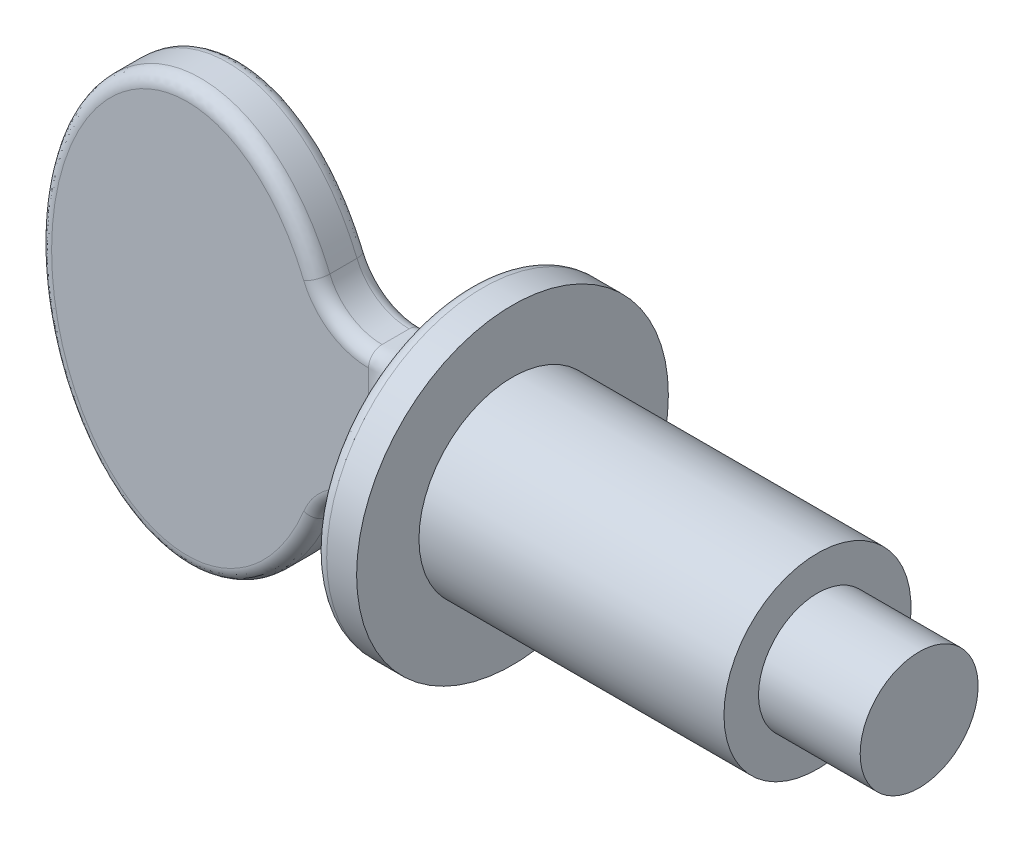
ISO-10303-21;
HEADER;
FILE_DESCRIPTION(('STEP AP214'),'2;1');
FILE_NAME('part.step','',(''),(''),'','','');
FILE_SCHEMA(('AUTOMOTIVE_DESIGN { 1 0 10303 214 1 1 1 1 }'));
ENDSEC;
DATA;
#1=APPLICATION_CONTEXT('core data for automotive mechanical design processes');
#2=APPLICATION_PROTOCOL_DEFINITION('international standard','automotive_design',2000,#1);
#3=PRODUCT_CONTEXT('',#1,'mechanical');
#4=PRODUCT('Part','Part','',(#3));
#5=PRODUCT_RELATED_PRODUCT_CATEGORY('part','',(#4));
#6=PRODUCT_DEFINITION_FORMATION('','',#4);
#7=PRODUCT_DEFINITION_CONTEXT('part definition',#1,'design');
#8=PRODUCT_DEFINITION('design','',#6,#7);
#9=PRODUCT_DEFINITION_SHAPE('','',#8);
#10=(LENGTH_UNIT() NAMED_UNIT(*) SI_UNIT(.MILLI.,.METRE.));
#11=(NAMED_UNIT(*) PLANE_ANGLE_UNIT() SI_UNIT($,.RADIAN.));
#12=(NAMED_UNIT(*) SI_UNIT($,.STERADIAN.) SOLID_ANGLE_UNIT());
#13=UNCERTAINTY_MEASURE_WITH_UNIT(LENGTH_MEASURE(1.E-05),#10,'distance_accuracy_value','');
#14=(GEOMETRIC_REPRESENTATION_CONTEXT(3) GLOBAL_UNCERTAINTY_ASSIGNED_CONTEXT((#13)) GLOBAL_UNIT_ASSIGNED_CONTEXT((#10,
#11,#12)) REPRESENTATION_CONTEXT('',''));
#15=CARTESIAN_POINT('',(0.,0.,0.));
#16=DIRECTION('',(0.,0.,1.));
#17=DIRECTION('',(1.,0.,0.));
#18=AXIS2_PLACEMENT_3D('',#15,#16,#17);
#19=CARTESIAN_POINT('',(3.39763741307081,-2.36920294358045,0.508));
#20=DIRECTION('',(0.,0.,-1.));
#21=DIRECTION('',(-1.,0.,0.));
#22=AXIS2_PLACEMENT_3D('',#19,#20,#21);
#23=CYLINDRICAL_SURFACE('',#22,1.05686961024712);
#24=DIRECTION('',(0.,0.,-1.));
#25=VECTOR('',#24,1.);
#26=CARTESIAN_POINT('',(2.41967497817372,-1.9685,0.508));
#27=LINE('',#26,#25);
#28=CARTESIAN_POINT('',(2.41967497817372,-1.9685,0.254));
#29=VERTEX_POINT('',#28);
#30=CARTESIAN_POINT('',(2.41967497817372,-1.9685,-0.254));
#31=VERTEX_POINT('',#30);
#32=EDGE_CURVE('E427',#29,#31,#27,.T.);
#33=ORIENTED_EDGE('',*,*,#32,.T.);
#34=CARTESIAN_POINT('',(3.39763741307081,-2.36920294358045,-0.254));
#35=DIRECTION('',(0.,0.,1.));
#36=DIRECTION('',(1.,0.,0.));
#37=AXIS2_PLACEMENT_3D('',#34,#35,#36);
#38=CIRCLE('',#37,1.05686961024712);
#39=CARTESIAN_POINT('',(3.39763741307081,-1.31233333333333,-0.254));
#40=VERTEX_POINT('',#39);
#41=EDGE_CURVE('E721',#31,#40,#38,.F.);
#42=ORIENTED_EDGE('',*,*,#41,.T.);
#43=DIRECTION('',(0.,0.,-1.));
#44=VECTOR('',#43,1.);
#45=CARTESIAN_POINT('',(3.39763741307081,-1.31233333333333,0.508));
#46=LINE('',#45,#44);
#47=CARTESIAN_POINT('',(3.39763741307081,-1.31233333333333,0.254));
#48=VERTEX_POINT('',#47);
#49=EDGE_CURVE('E360',#48,#40,#46,.T.);
#50=ORIENTED_EDGE('',*,*,#49,.F.);
#51=CARTESIAN_POINT('',(3.39763741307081,-2.36920294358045,0.254));
#52=DIRECTION('',(0.,0.,1.));
#53=DIRECTION('',(1.,0.,0.));
#54=AXIS2_PLACEMENT_3D('',#51,#52,#53);
#55=CIRCLE('',#54,1.05686961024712);
#56=EDGE_CURVE('E720',#48,#29,#55,.T.);
#57=ORIENTED_EDGE('',*,*,#56,.T.);
#58=EDGE_LOOP('',(#33,#42,#50,#57));
#59=FACE_BOUND('',#58,.T.);
#60=ADVANCED_FACE('F265',(#59),#23,.F.);
#61=CARTESIAN_POINT('',(3.39763741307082,2.36920294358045,0.508));
#62=DIRECTION('',(0.,0.,-1.));
#63=DIRECTION('',(-1.,0.,0.));
#64=AXIS2_PLACEMENT_3D('',#61,#62,#63);
#65=CYLINDRICAL_SURFACE('',#64,1.05686961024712);
#66=DIRECTION('',(0.,0.,-1.));
#67=VECTOR('',#66,1.);
#68=CARTESIAN_POINT('',(3.39763741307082,1.31233333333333,0.508));
#69=LINE('',#68,#67);
#70=CARTESIAN_POINT('',(3.39763741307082,1.31233333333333,0.254));
#71=VERTEX_POINT('',#70);
#72=CARTESIAN_POINT('',(3.39763741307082,1.31233333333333,-0.254));
#73=VERTEX_POINT('',#72);
#74=EDGE_CURVE('E613',#71,#73,#69,.T.);
#75=ORIENTED_EDGE('',*,*,#74,.T.);
#76=CARTESIAN_POINT('',(3.39763741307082,2.36920294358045,-0.254));
#77=DIRECTION('',(0.,0.,1.));
#78=DIRECTION('',(1.,0.,0.));
#79=AXIS2_PLACEMENT_3D('',#76,#77,#78);
#80=CIRCLE('',#79,1.05686961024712);
#81=CARTESIAN_POINT('',(2.41967497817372,1.9685,-0.254));
#82=VERTEX_POINT('',#81);
#83=EDGE_CURVE('E545',#73,#82,#80,.F.);
#84=ORIENTED_EDGE('',*,*,#83,.T.);
#85=DIRECTION('',(0.,0.,-1.));
#86=VECTOR('',#85,1.);
#87=CARTESIAN_POINT('',(2.41967497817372,1.9685,0.508));
#88=LINE('',#87,#86);
#89=CARTESIAN_POINT('',(2.41967497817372,1.9685,0.254));
#90=VERTEX_POINT('',#89);
#91=EDGE_CURVE('E611',#90,#82,#88,.T.);
#92=ORIENTED_EDGE('',*,*,#91,.F.);
#93=CARTESIAN_POINT('',(3.39763741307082,2.36920294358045,0.254));
#94=DIRECTION('',(0.,0.,1.));
#95=DIRECTION('',(1.,0.,0.));
#96=AXIS2_PLACEMENT_3D('',#93,#94,#95);
#97=CIRCLE('',#96,1.05686961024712);
#98=EDGE_CURVE('E538',#90,#71,#97,.T.);
#99=ORIENTED_EDGE('',*,*,#98,.T.);
#100=EDGE_LOOP('',(#75,#84,#92,#99));
#101=FACE_BOUND('',#100,.T.);
#102=ADVANCED_FACE('F434',(#101),#65,.F.);
#103=CARTESIAN_POINT('',(0.,0.,0.508));
#104=DIRECTION('',(0.,0.,1.));
#105=DIRECTION('',(0.,1.,0.));
#106=AXIS2_PLACEMENT_3D('',#103,#104,#105);
#107=ELLIPSE('',#106,3.937,2.794);
#108=DIRECTION('',(0.,0.,-1.));
#109=VECTOR('',#108,1.);
#110=SURFACE_OF_LINEAR_EXTRUSION('',#107,#109);
#111=ORIENTED_EDGE('',*,*,#91,.T.);
#112=CARTESIAN_POINT('',(-2.42953871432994,-1.06988650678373,-0.508));
#113=CARTESIAN_POINT('',(-2.67806308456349,-1.1223425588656,-0.508));
#114=CARTESIAN_POINT('',(-2.67806308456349,-1.1223425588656,-0.254));
#115=CARTESIAN_POINT('',(-2.38132756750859,-1.29830917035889,-0.508));
#116=CARTESIAN_POINT('',(-2.62738331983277,-1.36245895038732,-0.508));
#117=CARTESIAN_POINT('',(-2.62738331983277,-1.36245895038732,-0.254));
#118=CARTESIAN_POINT('',(-2.31706517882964,-1.52335296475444,-0.508));
#119=CARTESIAN_POINT('',(-2.55974244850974,-1.59951584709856,-0.508));
#120=CARTESIAN_POINT('',(-2.55974244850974,-1.59951584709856,-0.254));
#121=CARTESIAN_POINT('',(-2.15402597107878,-1.9606753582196,-0.508));
#122=CARTESIAN_POINT('',(-2.38735395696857,-2.06194694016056,-0.508));
#123=CARTESIAN_POINT('',(-2.38735395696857,-2.06194694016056,-0.254));
#124=CARTESIAN_POINT('',(-2.05530031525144,-2.17297233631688,-0.508));
#125=CARTESIAN_POINT('',(-2.28266133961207,-2.28733788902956,-0.508));
#126=CARTESIAN_POINT('',(-2.28266133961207,-2.28733788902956,-0.254));
#127=CARTESIAN_POINT('',(-1.8565056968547,-2.51319514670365,-0.508));
#128=CARTESIAN_POINT('',(-2.0702557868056,-2.65084271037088,-0.508));
#129=CARTESIAN_POINT('',(-2.0702557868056,-2.65084271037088,-0.254));
#130=CARTESIAN_POINT('',(-1.76631603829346,-2.64689289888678,-0.508));
#131=CARTESIAN_POINT('',(-1.97351333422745,-2.79437306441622,-0.508));
#132=CARTESIAN_POINT('',(-1.97351333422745,-2.79437306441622,-0.254));
#133=CARTESIAN_POINT('',(-1.56670354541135,-2.89917346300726,-0.508));
#134=CARTESIAN_POINT('',(-1.75790917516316,-3.06687436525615,-0.508));
#135=CARTESIAN_POINT('',(-1.75790917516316,-3.06687436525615,-0.254));
#136=CARTESIAN_POINT('',(-1.45730856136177,-3.01777773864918,-0.508));
#137=CARTESIAN_POINT('',(-1.63907948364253,-3.19586595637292,-0.508));
#138=CARTESIAN_POINT('',(-1.63907948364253,-3.19586595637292,-0.254));
#139=CARTESIAN_POINT('',(-1.24726681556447,-3.20759724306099,-0.508));
#140=CARTESIAN_POINT('',(-1.40883959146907,-3.40393298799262,-0.508));
#141=CARTESIAN_POINT('',(-1.40883959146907,-3.40393298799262,-0.254));
#142=CARTESIAN_POINT('',(-1.1507555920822,-3.28336841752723,-0.508));
#143=CARTESIAN_POINT('',(-1.30241841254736,-3.487576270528,-0.508));
#144=CARTESIAN_POINT('',(-1.30241841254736,-3.487576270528,-0.254));
#145=CARTESIAN_POINT('',(-0.946803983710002,-3.41849479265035,-0.508));
#146=CARTESIAN_POINT('',(-1.07576597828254,-3.63774144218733,-0.508));
#147=CARTESIAN_POINT('',(-1.07576597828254,-3.63774144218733,-0.254));
#148=CARTESIAN_POINT('',(-0.839378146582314,-3.47787146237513,-0.508));
#149=CARTESIAN_POINT('',(-0.955553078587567,-3.70428571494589,-0.508));
#150=CARTESIAN_POINT('',(-0.955553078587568,-3.70428571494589,-0.254));
#151=CARTESIAN_POINT('',(-0.633843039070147,-3.56789218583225,-0.508));
#152=CARTESIAN_POINT('',(-0.723818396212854,-3.80577636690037,-0.508));
#153=CARTESIAN_POINT('',(-0.723818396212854,-3.80577636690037,-0.254));
#154=CARTESIAN_POINT('',(-0.537108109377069,-3.60165598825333,-0.508));
#155=CARTESIAN_POINT('',(-0.614119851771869,-3.84411987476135,-0.508));
#156=CARTESIAN_POINT('',(-0.614119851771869,-3.84411987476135,-0.254));
#157=CARTESIAN_POINT('',(-0.339331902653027,-3.65248383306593,-0.508));
#158=CARTESIAN_POINT('',(-0.388801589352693,-3.90202243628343,-0.508));
#159=CARTESIAN_POINT('',(-0.388801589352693,-3.90202243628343,-0.254));
#160=CARTESIAN_POINT('',(-0.238293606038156,-3.66955924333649,-0.508));
#161=CARTESIAN_POINT('',(-0.273185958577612,-3.92159427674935,-0.508));
#162=CARTESIAN_POINT('',(-0.273185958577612,-3.92159427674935,-0.254));
#163=CARTESIAN_POINT('',(-0.0344753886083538,-3.68567445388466,-0.508));
#164=CARTESIAN_POINT('',(-0.0395873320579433,-3.94006182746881,-0.508));
#165=CARTESIAN_POINT('',(-0.0395873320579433,-3.94006182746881,-0.254));
#166=CARTESIAN_POINT('',(0.0683086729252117,-3.68466274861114,-0.508));
#167=CARTESIAN_POINT('',(0.0784014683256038,-3.93889849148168,-0.508));
#168=CARTESIAN_POINT('',(0.0784014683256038,-3.93889849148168,-0.254));
#169=CARTESIAN_POINT('',(0.272088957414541,-3.66456417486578,-0.508));
#170=CARTESIAN_POINT('',(0.311869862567,-3.91587428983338,-0.508));
#171=CARTESIAN_POINT('',(0.311869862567,-3.91587428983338,-0.254));
#172=CARTESIAN_POINT('',(0.373084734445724,-3.64547286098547,-0.508));
#173=CARTESIAN_POINT('',(0.427348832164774,-3.89400833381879,-0.508));
#174=CARTESIAN_POINT('',(0.427348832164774,-3.89400833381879,-0.254));
#175=CARTESIAN_POINT('',(0.566584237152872,-3.5918099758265,-0.508));
#176=CARTESIAN_POINT('',(0.647572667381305,-3.83293861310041,-0.508));
#177=CARTESIAN_POINT('',(0.647572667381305,-3.83293861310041,-0.254));
#178=CARTESIAN_POINT('',(0.659265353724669,-3.5578663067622,-0.508));
#179=CARTESIAN_POINT('',(0.75256001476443,-3.79443882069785,-0.508));
#180=CARTESIAN_POINT('',(0.75256001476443,-3.79443882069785,-0.254));
#181=CARTESIAN_POINT('',(0.838615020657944,-3.47679355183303,-0.508));
#182=CARTESIAN_POINT('',(0.954592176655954,-3.70311336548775,-0.508));
#183=CARTESIAN_POINT('',(0.954592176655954,-3.70311336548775,-0.254));
#184=CARTESIAN_POINT('',(0.925281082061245,-3.42965904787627,-0.508));
#185=CARTESIAN_POINT('',(1.05163370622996,-3.65028181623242,-0.508));
#186=CARTESIAN_POINT('',(1.05163370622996,-3.65028181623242,-0.254));
#187=CARTESIAN_POINT('',(1.12953179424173,-3.30045366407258,-0.508));
#188=CARTESIAN_POINT('',(1.27904250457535,-3.50643406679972,-0.508));
#189=CARTESIAN_POINT('',(1.27904250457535,-3.50643406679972,-0.254));
#190=CARTESIAN_POINT('',(1.24323792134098,-3.21224549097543,-0.508));
#191=CARTESIAN_POINT('',(1.40447787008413,-3.40898221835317,-0.508));
#192=CARTESIAN_POINT('',(1.40447787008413,-3.40898221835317,-0.254));
#193=CARTESIAN_POINT('',(1.45504675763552,-3.01870052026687,-0.508));
#194=CARTESIAN_POINT('',(1.63653892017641,-3.19692872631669,-0.508));
#195=CARTESIAN_POINT('',(1.63653892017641,-3.19692872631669,-0.254));
#196=CARTESIAN_POINT('',(1.55311138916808,-2.91332314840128,-0.508));
#197=CARTESIAN_POINT('',(1.74311876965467,-3.08228651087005,-0.508));
#198=CARTESIAN_POINT('',(1.74311876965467,-3.08228651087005,-0.254));
#199=CARTESIAN_POINT('',(1.75678198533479,-2.66196868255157,-0.508));
#200=CARTESIAN_POINT('',(1.9633248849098,-2.81052824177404,-0.508));
#201=CARTESIAN_POINT('',(1.9633248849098,-2.81052824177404,-0.254));
#202=CARTESIAN_POINT('',(1.85800944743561,-2.51246781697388,-0.508));
#203=CARTESIAN_POINT('',(2.07190130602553,-2.65000792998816,-0.508));
#204=CARTESIAN_POINT('',(2.07190130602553,-2.65000792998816,-0.254));
#205=CARTESIAN_POINT('',(2.03785333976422,-2.20076254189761,-0.508));
#206=CARTESIAN_POINT('',(2.26397611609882,-2.31709468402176,-0.508));
#207=CARTESIAN_POINT('',(2.26397611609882,-2.31709468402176,-0.254));
#208=CARTESIAN_POINT('',(2.11647846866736,-2.03856305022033,-0.508));
#209=CARTESIAN_POINT('',(2.34748415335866,-2.14470634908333,-0.508));
#210=CARTESIAN_POINT('',(2.34748415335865,-2.14470634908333,-0.254));
#211=CARTESIAN_POINT('',(2.22461915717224,-1.7746150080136,-0.508));
#212=CARTESIAN_POINT('',(2.46201925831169,-1.8651443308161,-0.508));
#213=CARTESIAN_POINT('',(2.46201925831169,-1.8651443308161,-0.254));
#214=CARTESIAN_POINT('',(2.2609989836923,-1.67559877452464,-0.508));
#215=CARTESIAN_POINT('',(2.5004698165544,-1.76047506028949,-0.508));
#216=CARTESIAN_POINT('',(2.5004698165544,-1.76047506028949,-0.254));
#217=CARTESIAN_POINT('',(2.32683156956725,-1.47533598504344,-0.508));
#218=CARTESIAN_POINT('',(2.56995291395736,-1.54910644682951,-0.508));
#219=CARTESIAN_POINT('',(2.56995291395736,-1.54910644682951,-0.254));
#220=CARTESIAN_POINT('',(2.35628633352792,-1.37409008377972,-0.508));
#221=CARTESIAN_POINT('',(2.60098759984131,-1.44240770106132,-0.508));
#222=CARTESIAN_POINT('',(2.60098759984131,-1.44240770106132,-0.254));
#223=CARTESIAN_POINT('',(2.45282237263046,-0.99672785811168,-0.508));
#224=CARTESIAN_POINT('',(2.70261039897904,-1.04518135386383,-0.508));
#225=CARTESIAN_POINT('',(2.70261039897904,-1.04518135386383,-0.254));
#226=CARTESIAN_POINT('',(2.49907252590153,-0.715044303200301,-0.508));
#227=CARTESIAN_POINT('',(2.7510952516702,-0.74956565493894,-0.508));
#228=CARTESIAN_POINT('',(2.7510952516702,-0.74956565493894,-0.254));
#229=CARTESIAN_POINT('',(2.54567248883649,-0.147495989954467,-0.508));
#230=CARTESIAN_POINT('',(2.79994937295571,-0.154504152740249,-0.508));
#231=CARTESIAN_POINT('',(2.79994937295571,-0.154504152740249,-0.254));
#232=CARTESIAN_POINT('',(2.54590842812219,0.138377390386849,-0.508));
#233=CARTESIAN_POINT('',(2.80019927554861,0.144949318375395,-0.508));
#234=CARTESIAN_POINT('',(2.80019927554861,0.144949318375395,-0.254));
#235=CARTESIAN_POINT('',(2.50314262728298,0.670744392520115,-0.508));
#236=CARTESIAN_POINT('',(2.75536014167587,0.703113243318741,-0.508));
#237=CARTESIAN_POINT('',(2.75536014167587,0.703113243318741,-0.254));
#238=CARTESIAN_POINT('',(2.46556625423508,0.917675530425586,-0.508));
#239=CARTESIAN_POINT('',(2.71596009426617,0.962218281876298,-0.508));
#240=CARTESIAN_POINT('',(2.71596009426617,0.962218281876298,-0.254));
#241=CARTESIAN_POINT('',(2.35351407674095,1.40317160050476,-0.508));
#242=CARTESIAN_POINT('',(2.5981091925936,1.47286514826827,-0.508));
#243=CARTESIAN_POINT('',(2.5981091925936,1.47286514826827,-0.254));
#244=CARTESIAN_POINT('',(2.27905720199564,1.64174075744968,-0.508));
#245=CARTESIAN_POINT('',(2.51967837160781,1.72441078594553,-0.508));
#246=CARTESIAN_POINT('',(2.51967837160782,1.72441078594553,-0.254));
#247=CARTESIAN_POINT('',(2.10296943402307,2.07153806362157,-0.508));
#248=CARTESIAN_POINT('',(2.33317448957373,2.17963119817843,-0.508));
#249=CARTESIAN_POINT('',(2.33317448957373,2.17963119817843,-0.254));
#250=CARTESIAN_POINT('',(2.00636516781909,2.26480890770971,-0.508));
#251=CARTESIAN_POINT('',(2.23053377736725,2.38518362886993,-0.508));
#252=CARTESIAN_POINT('',(2.23053377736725,2.38518362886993,-0.254));
#253=CARTESIAN_POINT('',(1.78047465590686,2.63124667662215,-0.508));
#254=CARTESIAN_POINT('',(1.98878457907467,2.77737954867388,-0.508));
#255=CARTESIAN_POINT('',(1.98878457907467,2.77737954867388,-0.254));
#256=CARTESIAN_POINT('',(1.65129083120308,2.80447416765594,-0.508));
#257=CARTESIAN_POINT('',(1.84979032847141,2.96407977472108,-0.508));
#258=CARTESIAN_POINT('',(1.84979032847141,2.96407977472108,-0.254));
#259=CARTESIAN_POINT('',(1.41779860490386,3.05444647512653,-0.508));
#260=CARTESIAN_POINT('',(1.59578914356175,3.23598875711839,-0.508));
#261=CARTESIAN_POINT('',(1.59578914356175,3.23598875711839,-0.254));
#262=CARTESIAN_POINT('',(1.32477852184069,3.14175732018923,-0.508));
#263=CARTESIAN_POINT('',(1.49405856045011,3.33156937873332,-0.508));
#264=CARTESIAN_POINT('',(1.49405856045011,3.33156937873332,-0.254));
#265=CARTESIAN_POINT('',(1.1264653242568,3.3011914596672,-0.508));
#266=CARTESIAN_POINT('',(1.27551873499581,3.50726804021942,-0.508));
#267=CARTESIAN_POINT('',(1.27551873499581,3.50726804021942,-0.254));
#268=CARTESIAN_POINT('',(1.02118853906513,3.37333460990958,-0.508));
#269=CARTESIAN_POINT('',(1.15872953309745,3.58740628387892,-0.508));
#270=CARTESIAN_POINT('',(1.15872953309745,3.58740628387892,-0.254));
#271=CARTESIAN_POINT('',(0.817330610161,3.48785914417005,-0.508));
#272=CARTESIAN_POINT('',(0.930720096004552,3.7154934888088,-0.508));
#273=CARTESIAN_POINT('',(0.930720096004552,3.7154934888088,-0.254));
#274=CARTESIAN_POINT('',(0.720402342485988,3.53316262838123,-0.508));
#275=CARTESIAN_POINT('',(0.821632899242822,3.76654812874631,-0.508));
#276=CARTESIAN_POINT('',(0.821632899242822,3.76654812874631,-0.254));
#277=CARTESIAN_POINT('',(0.520328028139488,3.60703504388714,-0.508));
#278=CARTESIAN_POINT('',(0.595089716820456,3.85018992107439,-0.508));
#279=CARTESIAN_POINT('',(0.595089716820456,3.85018992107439,-0.254));
#280=CARTESIAN_POINT('',(0.417186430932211,3.63561579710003,-0.508));
#281=CARTESIAN_POINT('',(0.477639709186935,3.88279011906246,-0.508));
#282=CARTESIAN_POINT('',(0.477639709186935,3.88279011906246,-0.254));
#283=CARTESIAN_POINT('',(0.206818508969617,3.67387815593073,-0.508));
#284=CARTESIAN_POINT('',(0.237206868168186,3.92651558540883,-0.508));
#285=CARTESIAN_POINT('',(0.237206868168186,3.92651558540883,-0.254));
#286=CARTESIAN_POINT('',(0.0995732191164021,3.68345742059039,-0.508));
#287=CARTESIAN_POINT('',(0.114197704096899,3.9375245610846,-0.508));
#288=CARTESIAN_POINT('',(0.114197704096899,3.9375245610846,-0.254));
#289=CARTESIAN_POINT('',(-0.114821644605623,3.68250895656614,-0.508));
#290=CARTESIAN_POINT('',(-0.131686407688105,3.93643687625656,-0.508));
#291=CARTESIAN_POINT('',(-0.131686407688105,3.93643687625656,-0.254));
#292=CARTESIAN_POINT('',(-0.221971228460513,3.67198365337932,-0.508));
#293=CARTESIAN_POINT('',(-0.254561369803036,3.92434300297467,-0.508));
#294=CARTESIAN_POINT('',(-0.254561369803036,3.92434300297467,-0.254));
#295=CARTESIAN_POINT('',(-0.423404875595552,3.6335702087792,-0.508));
#296=CARTESIAN_POINT('',(-0.484708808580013,3.88045959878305,-0.508));
#297=CARTESIAN_POINT('',(-0.484708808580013,3.88045959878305,-0.254));
#298=CARTESIAN_POINT('',(-0.517999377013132,3.60726509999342,-0.508));
#299=CARTESIAN_POINT('',(-0.592410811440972,3.85046695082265,-0.508));
#300=CARTESIAN_POINT('',(-0.592410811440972,3.85046695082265,-0.254));
#301=CARTESIAN_POINT('',(-0.702018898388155,3.54051420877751,-0.508));
#302=CARTESIAN_POINT('',(-0.80085538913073,3.77485728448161,-0.508));
#303=CARTESIAN_POINT('',(-0.800855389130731,3.77485728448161,-0.254));
#304=CARTESIAN_POINT('',(-0.791441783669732,3.5000626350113,-0.508));
#305=CARTESIAN_POINT('',(-0.901595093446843,3.72923386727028,-0.508));
#306=CARTESIAN_POINT('',(-0.901595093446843,3.72923386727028,-0.254));
#307=CARTESIAN_POINT('',(-0.995772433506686,3.38993421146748,-0.508));
#308=CARTESIAN_POINT('',(-1.13047031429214,3.60588286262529,-0.508));
#309=CARTESIAN_POINT('',(-1.13047031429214,3.60588286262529,-0.254));
#310=CARTESIAN_POINT('',(-1.10783636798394,3.31498239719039,-0.508));
#311=CARTESIAN_POINT('',(-1.25491481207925,3.52252387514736,-0.508));
#312=CARTESIAN_POINT('',(-1.25491481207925,3.52252387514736,-0.254));
#313=CARTESIAN_POINT('',(-1.31837395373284,3.14796333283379,-0.508));
#314=CARTESIAN_POINT('',(-1.48706802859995,3.33835616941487,-0.508));
#315=CARTESIAN_POINT('',(-1.48706802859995,3.33835616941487,-0.254));
#316=CARTESIAN_POINT('',(-1.41681992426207,3.05586208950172,-0.508));
#317=CARTESIAN_POINT('',(-1.59474271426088,3.23751282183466,-0.508));
#318=CARTESIAN_POINT('',(-1.59474271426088,3.23751282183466,-0.254));
#319=CARTESIAN_POINT('',(-1.63609804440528,2.82020806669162,-0.508));
#320=CARTESIAN_POINT('',(-1.83323646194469,2.98121697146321,-0.508));
#321=CARTESIAN_POINT('',(-1.83323646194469,2.98121697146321,-0.254));
#322=CARTESIAN_POINT('',(-1.75048386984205,2.67067473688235,-0.508));
#323=CARTESIAN_POINT('',(-1.95647717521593,2.81989583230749,-0.508));
#324=CARTESIAN_POINT('',(-1.95647717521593,2.81989583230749,-0.254));
#325=CARTESIAN_POINT('',(-1.95420988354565,2.35553788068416,-0.508));
#326=CARTESIAN_POINT('',(-2.1748556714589,2.48207587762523,-0.508));
#327=CARTESIAN_POINT('',(-2.1748556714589,2.48207587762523,-0.254));
#328=CARTESIAN_POINT('',(-2.04350621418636,2.18990688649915,-0.508));
#329=CARTESIAN_POINT('',(-2.2699442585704,2.30555118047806,-0.508));
#330=CARTESIAN_POINT('',(-2.2699442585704,2.30555118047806,-0.254));
#331=CARTESIAN_POINT('',(-2.22882804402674,1.78241164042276,-0.508));
#332=CARTESIAN_POINT('',(-2.46665332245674,1.87302961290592,-0.508));
#333=CARTESIAN_POINT('',(-2.46665332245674,1.87302961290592,-0.254));
#334=CARTESIAN_POINT('',(-2.3142397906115,1.53572223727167,-0.508));
#335=CARTESIAN_POINT('',(-2.55672789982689,1.61257271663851,-0.508));
#336=CARTESIAN_POINT('',(-2.55672789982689,1.61257271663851,-0.254));
#337=CARTESIAN_POINT('',(-2.44446639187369,1.03199799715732,-0.508));
#338=CARTESIAN_POINT('',(-2.69381177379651,1.08228449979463,-0.508));
#339=CARTESIAN_POINT('',(-2.69381177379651,1.08228449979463,-0.254));
#340=CARTESIAN_POINT('',(-2.48924065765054,0.774953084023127,-0.508));
#341=CARTESIAN_POINT('',(-2.74077801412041,0.812444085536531,-0.508));
#342=CARTESIAN_POINT('',(-2.74077801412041,0.812444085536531,-0.254));
#343=CARTESIAN_POINT('',(-2.54075598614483,0.251563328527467,-0.508));
#344=CARTESIAN_POINT('',(-2.79480168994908,0.263568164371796,-0.508));
#345=CARTESIAN_POINT('',(-2.79480168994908,0.263568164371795,-0.254));
#346=CARTESIAN_POINT('',(-2.54666205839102,-0.0148627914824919,-0.508));
#347=CARTESIAN_POINT('',(-2.80098296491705,-0.015540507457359,-0.508));
#348=CARTESIAN_POINT('',(-2.80098296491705,-0.0155405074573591,-0.254));
#349=CARTESIAN_POINT('',(-2.51848120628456,-0.545613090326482,-0.508));
#350=CARTESIAN_POINT('',(-2.77144588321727,-0.571867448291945,-0.508));
#351=CARTESIAN_POINT('',(-2.77144588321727,-0.571867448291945,-0.254));
#352=CARTESIAN_POINT('',(-2.48440379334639,-0.809937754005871,-0.508));
#353=CARTESIAN_POINT('',(-2.73573749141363,-0.849086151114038,-0.508));
#354=CARTESIAN_POINT('',(-2.73573749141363,-0.849086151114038,-0.254));
#355=CARTESIAN_POINT('',(-2.42953871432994,-1.06988650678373,-0.508));
#356=CARTESIAN_POINT('',(-2.67806308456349,-1.1223425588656,-0.508));
#357=CARTESIAN_POINT('',(-2.67806308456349,-1.1223425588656,-0.254));
#358=(BOUNDED_SURFACE() B_SPLINE_SURFACE(3,2,((#112,#113,#114),(#115,#116,#117),(#118,#119,
#120),(#121,#122,#123),(#124,#125,#126),(#127,#128,#129),(#130,#131,#132),(#133,#134,#135),
(#136,#137,#138),(#139,#140,#141),(#142,#143,#144),(#145,#146,#147),(#148,#149,#150),(#151,#152,
#153),(#154,#155,#156),(#157,#158,#159),(#160,#161,#162),(#163,#164,#165),(#166,#167,#168),
(#169,#170,#171),(#172,#173,#174),(#175,#176,#177),(#178,#179,#180),(#181,#182,#183),(#184,#185,
#186),(#187,#188,#189),(#190,#191,#192),(#193,#194,#195),(#196,#197,#198),(#199,#200,#201),
(#202,#203,#204),(#205,#206,#207),(#208,#209,#210),(#211,#212,#213),(#214,#215,#216),(#217,#218,
#219),(#220,#221,#222),(#223,#224,#225),(#226,#227,#228),(#229,#230,#231),(#232,#233,#234),
(#235,#236,#237),(#238,#239,#240),(#241,#242,#243),(#244,#245,#246),(#247,#248,#249),(#250,#251,
#252),(#253,#254,#255),(#256,#257,#258),(#259,#260,#261),(#262,#263,#264),(#265,#266,#267),
(#268,#269,#270),(#271,#272,#273),(#274,#275,#276),(#277,#278,#279),(#280,#281,#282),(#283,#284,
#285),(#286,#287,#288),(#289,#290,#291),(#292,#293,#294),(#295,#296,#297),(#298,#299,#300),
(#301,#302,#303),(#304,#305,#306),(#307,#308,#309),(#310,#311,#312),(#313,#314,#315),(#316,#317,
#318),(#319,#320,#321),(#322,#323,#324),(#325,#326,#327),(#328,#329,#330),(#331,#332,#333),
(#334,#335,#336),(#337,#338,#339),(#340,#341,#342),(#343,#344,#345),(#346,#347,#348),(#349,#350,
#351),(#352,#353,#354),(#355,#356,#357)),.UNSPECIFIED.,.T.,.F.,
.F.) B_SPLINE_SURFACE_WITH_KNOTS((4,2,2,2,2,2,2,2,2,2,2,2,2,2,2,2,2,2,2,2,2,2,2,2,2,2,2,2,2,2,2,
2,2,2,2,2,2,2,2,2,4),(3,3),(0.,0.699735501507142,1.39843658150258,1.88081590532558,
2.36250140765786,2.7293120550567,3.09564005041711,3.401707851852,3.7075670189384,
4.01429730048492,4.32110302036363,4.61603131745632,4.91108093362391,5.34040544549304,
5.77075965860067,6.31008999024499,6.84921247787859,7.16544039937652,7.48157666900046,
8.33348152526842,9.18749454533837,9.93427445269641,10.6806714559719,11.3262865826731,
11.9698968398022,12.3514499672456,12.7325004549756,13.052173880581,13.371621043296,
13.6927841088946,14.0139084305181,14.3072154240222,14.6006426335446,15.0028628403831,
15.405888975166,15.9675913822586,16.530269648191,17.3092934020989,18.0890943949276,
18.8855943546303,19.6819048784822),(0.,1.),
.UNSPECIFIED.) GEOMETRIC_REPRESENTATION_ITEM() RATIONAL_B_SPLINE_SURFACE(((1.,0.707106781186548,
1.),(1.,0.707106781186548,1.),(1.,0.707106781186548,1.),(1.,0.707106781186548,1.),(1.,
0.707106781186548,1.),(1.,0.707106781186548,1.),(1.,0.707106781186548,1.),(1.,0.707106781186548,
1.),(1.,0.707106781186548,1.),(1.,0.707106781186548,1.),(1.,0.707106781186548,1.),(1.,
0.707106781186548,1.),(1.,0.707106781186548,1.),(1.,0.707106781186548,1.),(1.,0.707106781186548,
1.),(1.,0.707106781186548,1.),(1.,0.707106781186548,1.),(1.,0.707106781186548,1.),(1.,
0.707106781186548,1.),(1.,0.707106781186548,1.),(1.,0.707106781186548,1.),(1.,0.707106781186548,
1.),(1.,0.707106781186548,1.),(1.,0.707106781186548,1.),(1.,0.707106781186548,1.),(1.,
0.707106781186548,1.),(1.,0.707106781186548,1.),(1.,0.707106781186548,1.),(1.,0.707106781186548,
1.),(1.,0.707106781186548,1.),(1.,0.707106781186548,1.),(1.,0.707106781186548,1.),(1.,
0.707106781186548,1.),(1.,0.707106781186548,1.),(1.,0.707106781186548,1.),(1.,0.707106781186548,
1.),(1.,0.707106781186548,1.),(1.,0.707106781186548,1.),(1.,0.707106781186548,1.),(1.,
0.707106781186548,1.),(1.,0.707106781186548,1.),(1.,0.707106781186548,1.),(1.,0.707106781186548,
1.),(1.,0.707106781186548,1.),(1.,0.707106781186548,1.),(1.,0.707106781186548,1.),(1.,
0.707106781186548,1.),(1.,0.707106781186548,1.),(1.,0.707106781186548,1.),(1.,0.707106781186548,
1.),(1.,0.707106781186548,1.),(1.,0.707106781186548,1.),(1.,0.707106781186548,1.),(1.,
0.707106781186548,1.),(1.,0.707106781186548,1.),(1.,0.707106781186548,1.),(1.,0.707106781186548,
1.),(1.,0.707106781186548,1.),(1.,0.707106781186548,1.),(1.,0.707106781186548,1.),(1.,
0.707106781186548,1.),(1.,0.707106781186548,1.),(1.,0.707106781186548,1.),(1.,0.707106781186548,
1.),(1.,0.707106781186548,1.),(1.,0.707106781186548,1.),(1.,0.707106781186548,1.),(1.,
0.707106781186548,1.),(1.,0.707106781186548,1.),(1.,0.707106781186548,1.),(1.,0.707106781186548,
1.),(1.,0.707106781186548,1.),(1.,0.707106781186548,1.),(1.,0.707106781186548,1.),(1.,
0.707106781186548,1.),(1.,0.707106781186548,1.),(1.,0.707106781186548,1.),(1.,0.707106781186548,
1.),(1.,0.707106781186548,1.),(1.,0.707106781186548,1.),(1.,0.707106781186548,1.),(1.,
0.707106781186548,1.))) REPRESENTATION_ITEM('') SURFACE());
#359=CARTESIAN_POINT('',(2.41967497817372,1.9685,-0.254));
#360=CARTESIAN_POINT('',(2.25031042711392,2.38542945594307,-0.254));
#361=CARTESIAN_POINT('',(2.00596675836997,2.79648158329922,-0.254));
#362=CARTESIAN_POINT('',(1.49799160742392,3.34093166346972,-0.254));
#363=CARTESIAN_POINT('',(1.27918524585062,3.52006526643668,-0.254));
#364=CARTESIAN_POINT('',(0.824519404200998,3.77487228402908,-0.254));
#365=CARTESIAN_POINT('',(0.5953372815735,3.86152000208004,-0.254));
#366=CARTESIAN_POINT('',(0.11627433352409,3.94837182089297,-0.254));
#367=CARTESIAN_POINT('',(-0.133883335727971,3.94714153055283,-0.254));
#368=CARTESIAN_POINT('',(-0.592713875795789,3.86005719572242,-0.254));
#369=CARTESIAN_POINT('',(-0.803064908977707,3.78232434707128,-0.254));
#370=CARTESIAN_POINT('',(-1.25884339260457,3.53671269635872,-0.254));
#371=CARTESIAN_POINT('',(-1.49225794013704,3.34730250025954,-0.254));
#372=CARTESIAN_POINT('',(-1.9688886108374,2.83590773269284,-0.254));
#373=CARTESIAN_POINT('',(-2.18567037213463,2.49073765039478,-0.254));
#374=CARTESIAN_POINT('',(-2.57946081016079,1.62514496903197,-0.254));
#375=CARTESIAN_POINT('',(-2.71380281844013,1.08646076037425,-0.254));
#376=CARTESIAN_POINT('',(-2.82215303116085,-0.0142692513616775,-0.254));
#377=CARTESIAN_POINT('',(-2.79328752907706,-0.576559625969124,-0.254));
#378=CARTESIAN_POINT('',(-2.5760189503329,-1.60569439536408,-0.254));
#379=CARTESIAN_POINT('',(-2.40624277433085,-2.07609930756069,-0.254));
#380=CARTESIAN_POINT('',(-1.98146625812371,-2.80261486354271,-0.254));
#381=CARTESIAN_POINT('',(-1.76650882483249,-3.08096180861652,-0.254));
#382=CARTESIAN_POINT('',(-1.30657381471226,-3.49615219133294,-0.254));
#383=CARTESIAN_POINT('',(-1.07838575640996,-3.65062001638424,-0.254));
#384=CARTESIAN_POINT('',(-0.616409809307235,-3.85270583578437,-0.254));
#385=CARTESIAN_POINT('',(-0.388253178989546,-3.91258803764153,-0.254));
#386=CARTESIAN_POINT('',(0.0769150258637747,-3.94918083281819,-0.254));
#387=CARTESIAN_POINT('',(0.313980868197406,-3.92525354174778,-0.254));
#388=CARTESIAN_POINT('',(0.753403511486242,-3.80377336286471,-0.254));
#389=CARTESIAN_POINT('',(0.956930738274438,-3.71016433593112,-0.254));
#390=CARTESIAN_POINT('',(1.40977740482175,-3.42376866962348,-0.254));
#391=CARTESIAN_POINT('',(1.6427552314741,-3.20589476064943,-0.254));
#392=CARTESIAN_POINT('',(2.03111441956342,-2.72710992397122,-0.254));
#393=CARTESIAN_POINT('',(2.18919790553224,-2.46823947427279,-0.254));
#394=CARTESIAN_POINT('',(2.35453247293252,-2.12142025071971,-0.254));
#395=CARTESIAN_POINT('',(2.38815642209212,-2.04532960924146,-0.254));
#396=CARTESIAN_POINT('',(2.41967497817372,-1.9685,-0.254));
#397=B_SPLINE_CURVE_WITH_KNOTS('',3,(#359,#360,#361,#362,#363,#364,#365,#366,#367,#368,#369,
#370,#371,#372,#373,#374,#375,#376,#377,#378,#379,#380,#381,#382,#383,#384,#385,#386,#387,#388,
#389,#390,#391,#392,#393,#394,#395,#396),.UNSPECIFIED.,.F.,.F.,(4,2,2,2,2,2,2,2,2,2,2,2,2,2,2,2,
2,2,4),(0.,1.37556453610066,2.21375379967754,2.93458248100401,3.66717955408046,4.32956836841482,
5.21483606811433,6.41718702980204,8.05393798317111,9.71959706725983,11.1947245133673,
12.2336794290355,13.0458946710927,13.740094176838,14.4395887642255,15.1022444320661,
16.0414723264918,16.9435917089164,17.1929672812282),.UNSPECIFIED.);
#398=EDGE_CURVE('E469',#82,#31,#397,.T.);
#399=ORIENTED_EDGE('',*,*,#398,.T.);
#400=ORIENTED_EDGE('',*,*,#32,.F.);
#401=CARTESIAN_POINT('',(-2.42953871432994,1.06988650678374,0.508));
#402=CARTESIAN_POINT('',(-2.67806308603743,1.12234255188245,0.508));
#403=CARTESIAN_POINT('',(-2.67806308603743,1.12234255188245,0.254));
#404=CARTESIAN_POINT('',(-2.38132756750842,1.29830917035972,0.508));
#405=CARTESIAN_POINT('',(-2.62738332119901,1.36245894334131,0.508));
#406=CARTESIAN_POINT('',(-2.62738332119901,1.36245894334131,0.254));
#407=CARTESIAN_POINT('',(-2.31706517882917,1.52335296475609,0.508));
#408=CARTESIAN_POINT('',(-2.55974244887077,1.59951584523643,0.508));
#409=CARTESIAN_POINT('',(-2.55974244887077,1.59951584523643,0.254));
#410=CARTESIAN_POINT('',(-2.15402597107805,1.96067535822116,0.508));
#411=CARTESIAN_POINT('',(-2.38735395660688,2.06194694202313,0.508));
#412=CARTESIAN_POINT('',(-2.38735395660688,2.06194694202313,0.254));
#413=CARTESIAN_POINT('',(-2.05530031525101,2.17297233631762,0.508));
#414=CARTESIAN_POINT('',(-2.28266133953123,2.28733788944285,0.508));
#415=CARTESIAN_POINT('',(-2.28266133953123,2.28733788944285,0.254));
#416=CARTESIAN_POINT('',(-1.8565056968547,2.51319514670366,0.508));
#417=CARTESIAN_POINT('',(-2.07025578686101,2.65084271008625,0.508));
#418=CARTESIAN_POINT('',(-2.07025578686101,2.65084271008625,0.254));
#419=CARTESIAN_POINT('',(-1.76631603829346,2.64689289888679,0.508));
#420=CARTESIAN_POINT('',(-1.97351333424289,2.79437306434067,0.508));
#421=CARTESIAN_POINT('',(-1.97351333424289,2.79437306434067,0.254));
#422=CARTESIAN_POINT('',(-1.56670354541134,2.89917346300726,0.508));
#423=CARTESIAN_POINT('',(-1.75790917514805,3.06687436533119,0.508));
#424=CARTESIAN_POINT('',(-1.75790917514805,3.06687436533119,0.254));
#425=CARTESIAN_POINT('',(-1.45730856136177,3.01777773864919,0.508));
#426=CARTESIAN_POINT('',(-1.63907948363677,3.19586595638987,0.508));
#427=CARTESIAN_POINT('',(-1.63907948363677,3.19586595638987,0.254));
#428=CARTESIAN_POINT('',(-1.24726681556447,3.20759724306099,0.508));
#429=CARTESIAN_POINT('',(-1.40883959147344,3.40393298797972,0.508));
#430=CARTESIAN_POINT('',(-1.40883959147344,3.40393298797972,0.254));
#431=CARTESIAN_POINT('',(-1.1507555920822,3.28336841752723,0.508));
#432=CARTESIAN_POINT('',(-1.30241841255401,3.48757627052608,0.508));
#433=CARTESIAN_POINT('',(-1.30241841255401,3.48757627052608,0.254));
#434=CARTESIAN_POINT('',(-0.946803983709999,3.41849479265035,0.508));
#435=CARTESIAN_POINT('',(-1.07576597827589,3.63774144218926,0.508));
#436=CARTESIAN_POINT('',(-1.07576597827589,3.63774144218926,0.254));
#437=CARTESIAN_POINT('',(-0.839378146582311,3.47787146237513,0.508));
#438=CARTESIAN_POINT('',(-0.955553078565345,3.70428571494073,0.508));
#439=CARTESIAN_POINT('',(-0.955553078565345,3.70428571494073,0.254));
#440=CARTESIAN_POINT('',(-0.633843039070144,3.56789218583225,0.508));
#441=CARTESIAN_POINT('',(-0.723818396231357,3.80577636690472,0.508));
#442=CARTESIAN_POINT('',(-0.723818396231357,3.80577636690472,0.254));
#443=CARTESIAN_POINT('',(-0.537108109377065,3.60165598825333,0.508));
#444=CARTESIAN_POINT('',(-0.614119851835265,3.84411987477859,0.508));
#445=CARTESIAN_POINT('',(-0.614119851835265,3.84411987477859,0.254));
#446=CARTESIAN_POINT('',(-0.339331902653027,3.65248383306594,0.508));
#447=CARTESIAN_POINT('',(-0.388801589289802,3.90202243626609,0.508));
#448=CARTESIAN_POINT('',(-0.388801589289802,3.90202243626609,0.254));
#449=CARTESIAN_POINT('',(-0.238293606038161,3.6695592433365,0.508));
#450=CARTESIAN_POINT('',(-0.273185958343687,3.92159427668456,0.508));
#451=CARTESIAN_POINT('',(-0.273185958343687,3.92159427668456,0.254));
#452=CARTESIAN_POINT('',(-0.0344753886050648,3.68567445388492,0.508));
#453=CARTESIAN_POINT('',(-0.0395873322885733,3.94006182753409,0.508));
#454=CARTESIAN_POINT('',(-0.0395873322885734,3.94006182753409,0.254));
#455=CARTESIAN_POINT('',(0.0683086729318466,3.68466274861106,0.508));
#456=CARTESIAN_POINT('',(0.0784014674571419,3.93889849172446,0.508));
#457=CARTESIAN_POINT('',(0.0784014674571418,3.93889849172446,0.254));
#458=CARTESIAN_POINT('',(0.272088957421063,3.66456417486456,0.508));
#459=CARTESIAN_POINT('',(0.311869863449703,3.91587428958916,0.508));
#460=CARTESIAN_POINT('',(0.311869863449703,3.91587428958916,0.254));
#461=CARTESIAN_POINT('',(0.373084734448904,3.64547286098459,0.508));
#462=CARTESIAN_POINT('',(0.427348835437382,3.89400833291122,0.508));
#463=CARTESIAN_POINT('',(0.427348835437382,3.89400833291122,0.254));
#464=CARTESIAN_POINT('',(0.566584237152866,3.5918099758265,0.508));
#465=CARTESIAN_POINT('',(0.647572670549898,3.83293861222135,0.508));
#466=CARTESIAN_POINT('',(0.647572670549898,3.83293861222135,0.254));
#467=CARTESIAN_POINT('',(0.659265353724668,3.5578663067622,0.508));
#468=CARTESIAN_POINT('',(0.752560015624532,3.79443882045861,0.508));
#469=CARTESIAN_POINT('',(0.752560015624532,3.79443882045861,0.254));
#470=CARTESIAN_POINT('',(0.838615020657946,3.47679355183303,0.508));
#471=CARTESIAN_POINT('',(0.954592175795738,3.70311336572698,0.508));
#472=CARTESIAN_POINT('',(0.954592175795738,3.70311336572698,0.254));
#473=CARTESIAN_POINT('',(0.925281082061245,3.42965904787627,0.508));
#474=CARTESIAN_POINT('',(1.05163370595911,3.65028181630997,0.508));
#475=CARTESIAN_POINT('',(1.05163370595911,3.65028181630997,0.254));
#476=CARTESIAN_POINT('',(1.12953179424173,3.30045366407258,0.508));
#477=CARTESIAN_POINT('',(1.2790425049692,3.50643406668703,0.508));
#478=CARTESIAN_POINT('',(1.2790425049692,3.50643406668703,0.254));
#479=CARTESIAN_POINT('',(1.24323792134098,3.21224549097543,0.508));
#480=CARTESIAN_POINT('',(1.40447787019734,3.40898221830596,0.508));
#481=CARTESIAN_POINT('',(1.40447787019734,3.40898221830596,0.254));
#482=CARTESIAN_POINT('',(1.45504675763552,3.01870052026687,0.508));
#483=CARTESIAN_POINT('',(1.63653892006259,3.19692872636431,0.508));
#484=CARTESIAN_POINT('',(1.63653892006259,3.19692872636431,0.254));
#485=CARTESIAN_POINT('',(1.55311138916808,2.91332314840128,0.508));
#486=CARTESIAN_POINT('',(1.74311876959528,3.08228651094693,0.508));
#487=CARTESIAN_POINT('',(1.74311876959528,3.08228651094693,0.254));
#488=CARTESIAN_POINT('',(1.75678198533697,2.66196868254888,0.508));
#489=CARTESIAN_POINT('',(1.96332488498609,2.8105282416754,0.508));
#490=CARTESIAN_POINT('',(1.96332488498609,2.8105282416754,0.254));
#491=CARTESIAN_POINT('',(1.85800944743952,2.51246781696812,0.508));
#492=CARTESIAN_POINT('',(2.07190130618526,2.65000792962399,0.508));
#493=CARTESIAN_POINT('',(2.07190130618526,2.65000792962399,0.254));
#494=CARTESIAN_POINT('',(2.03785333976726,2.20076254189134,0.508));
#495=CARTESIAN_POINT('',(2.26397611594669,2.31709468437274,0.508));
#496=CARTESIAN_POINT('',(2.26397611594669,2.31709468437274,0.254));
#497=CARTESIAN_POINT('',(2.11647846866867,2.03856305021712,0.508));
#498=CARTESIAN_POINT('',(2.34748415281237,2.14470635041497,0.508));
#499=CARTESIAN_POINT('',(2.34748415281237,2.14470635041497,0.254));
#500=CARTESIAN_POINT('',(2.22461915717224,1.7746150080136,0.508));
#501=CARTESIAN_POINT('',(2.4620192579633,1.86514433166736,0.508));
#502=CARTESIAN_POINT('',(2.4620192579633,1.86514433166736,0.254));
#503=CARTESIAN_POINT('',(2.2609989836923,1.67559877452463,0.508));
#504=CARTESIAN_POINT('',(2.50046981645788,1.7604750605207,0.508));
#505=CARTESIAN_POINT('',(2.50046981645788,1.7604750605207,0.254));
#506=CARTESIAN_POINT('',(2.32683156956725,1.47533598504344,0.508));
#507=CARTESIAN_POINT('',(2.56995291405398,1.54910644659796,0.508));
#508=CARTESIAN_POINT('',(2.56995291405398,1.54910644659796,0.254));
#509=CARTESIAN_POINT('',(2.35628633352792,1.37409008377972,0.508));
#510=CARTESIAN_POINT('',(2.6009875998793,1.44240770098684,0.508));
#511=CARTESIAN_POINT('',(2.6009875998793,1.44240770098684,0.254));
#512=CARTESIAN_POINT('',(2.45282237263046,0.996727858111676,0.508));
#513=CARTESIAN_POINT('',(2.7026103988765,1.04518135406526,0.508));
#514=CARTESIAN_POINT('',(2.7026103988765,1.04518135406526,0.254));
#515=CARTESIAN_POINT('',(2.49907252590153,0.715044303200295,0.508));
#516=CARTESIAN_POINT('',(2.75109525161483,0.749565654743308,0.508));
#517=CARTESIAN_POINT('',(2.75109525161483,0.749565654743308,0.254));
#518=CARTESIAN_POINT('',(2.54567248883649,0.147495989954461,0.508));
#519=CARTESIAN_POINT('',(2.79994937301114,0.154504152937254,0.508));
#520=CARTESIAN_POINT('',(2.79994937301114,0.154504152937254,0.254));
#521=CARTESIAN_POINT('',(2.54590842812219,-0.138377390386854,0.508));
#522=CARTESIAN_POINT('',(2.80019927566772,-0.144949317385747,0.508));
#523=CARTESIAN_POINT('',(2.80019927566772,-0.144949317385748,0.254));
#524=CARTESIAN_POINT('',(2.50314262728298,-0.67074439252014,0.508));
#525=CARTESIAN_POINT('',(2.75536014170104,-0.703113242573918,0.508));
#526=CARTESIAN_POINT('',(2.75536014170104,-0.703113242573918,0.254));
#527=CARTESIAN_POINT('',(2.46556625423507,-0.917675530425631,0.508));
#528=CARTESIAN_POINT('',(2.71596009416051,-0.962218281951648,0.508));
#529=CARTESIAN_POINT('',(2.7159600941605,-0.962218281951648,0.254));
#530=CARTESIAN_POINT('',(2.35351407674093,-1.4031716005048,0.508));
#531=CARTESIAN_POINT('',(2.59810919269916,-1.47286514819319,0.508));
#532=CARTESIAN_POINT('',(2.59810919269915,-1.47286514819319,0.254));
#533=CARTESIAN_POINT('',(2.27905720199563,-1.6417407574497,0.508));
#534=CARTESIAN_POINT('',(2.51967837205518,-1.72441078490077,0.508));
#535=CARTESIAN_POINT('',(2.51967837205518,-1.72441078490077,0.254));
#536=CARTESIAN_POINT('',(2.10296943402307,-2.07153806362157,0.508));
#537=CARTESIAN_POINT('',(2.33317448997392,-2.17963119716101,0.508));
#538=CARTESIAN_POINT('',(2.33317448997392,-2.17963119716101,0.254));
#539=CARTESIAN_POINT('',(2.00636516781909,-2.26480890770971,0.508));
#540=CARTESIAN_POINT('',(2.2305337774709,-2.38518362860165,0.508));
#541=CARTESIAN_POINT('',(2.2305337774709,-2.38518362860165,0.254));
#542=CARTESIAN_POINT('',(1.78047465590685,-2.63124667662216,0.508));
#543=CARTESIAN_POINT('',(1.98878457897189,-2.77737954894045,0.508));
#544=CARTESIAN_POINT('',(1.98878457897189,-2.77737954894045,0.254));
#545=CARTESIAN_POINT('',(1.65129083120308,-2.80447416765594,0.508));
#546=CARTESIAN_POINT('',(1.84979032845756,-2.96407977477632,0.508));
#547=CARTESIAN_POINT('',(1.84979032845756,-2.96407977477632,0.254));
#548=CARTESIAN_POINT('',(1.41779860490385,-3.05444647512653,0.508));
#549=CARTESIAN_POINT('',(1.59578914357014,-3.23598875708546,0.508));
#550=CARTESIAN_POINT('',(1.59578914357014,-3.23598875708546,0.254));
#551=CARTESIAN_POINT('',(1.32477852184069,-3.14175732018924,0.508));
#552=CARTESIAN_POINT('',(1.49405856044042,-3.33156937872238,0.508));
#553=CARTESIAN_POINT('',(1.49405856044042,-3.33156937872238,0.254));
#554=CARTESIAN_POINT('',(1.1264653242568,-3.30119145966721,0.508));
#555=CARTESIAN_POINT('',(1.27551873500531,-3.50726804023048,0.508));
#556=CARTESIAN_POINT('',(1.27551873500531,-3.50726804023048,0.254));
#557=CARTESIAN_POINT('',(1.02118853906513,-3.37333460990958,0.508));
#558=CARTESIAN_POINT('',(1.15872953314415,-3.58740628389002,0.508));
#559=CARTESIAN_POINT('',(1.15872953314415,-3.58740628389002,0.254));
#560=CARTESIAN_POINT('',(0.817330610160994,-3.48785914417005,0.508));
#561=CARTESIAN_POINT('',(0.930720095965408,-3.71549348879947,0.508));
#562=CARTESIAN_POINT('',(0.930720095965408,-3.71549348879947,0.254));
#563=CARTESIAN_POINT('',(0.720402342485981,-3.53316262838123,0.508));
#564=CARTESIAN_POINT('',(0.821632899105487,-3.76654812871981,0.508));
#565=CARTESIAN_POINT('',(0.821632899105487,-3.76654812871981,0.254));
#566=CARTESIAN_POINT('',(0.520328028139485,-3.60703504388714,0.508));
#567=CARTESIAN_POINT('',(0.595089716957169,-3.85018992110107,0.508));
#568=CARTESIAN_POINT('',(0.595089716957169,-3.85018992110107,0.254));
#569=CARTESIAN_POINT('',(0.417186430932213,-3.63561579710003,0.508));
#570=CARTESIAN_POINT('',(0.477639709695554,-3.88279011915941,0.508));
#571=CARTESIAN_POINT('',(0.477639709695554,-3.88279011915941,0.254));
#572=CARTESIAN_POINT('',(0.206818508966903,-3.67387815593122,0.508));
#573=CARTESIAN_POINT('',(0.237206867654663,-3.92651558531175,0.508));
#574=CARTESIAN_POINT('',(0.237206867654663,-3.92651558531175,0.254));
#575=CARTESIAN_POINT('',(0.0995732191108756,-3.68345742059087,0.508));
#576=CARTESIAN_POINT('',(0.114197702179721,-3.93752456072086,0.508));
#577=CARTESIAN_POINT('',(0.114197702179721,-3.93752456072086,0.254));
#578=CARTESIAN_POINT('',(-0.114821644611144,-3.68250895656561,0.508));
#579=CARTESIAN_POINT('',(-0.131686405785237,-3.93643687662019,0.508));
#580=CARTESIAN_POINT('',(-0.131686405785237,-3.93643687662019,0.254));
#581=CARTESIAN_POINT('',(-0.221971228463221,-3.67198365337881,0.508));
#582=CARTESIAN_POINT('',(-0.254561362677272,-3.92434300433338,0.508));
#583=CARTESIAN_POINT('',(-0.254561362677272,-3.92434300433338,0.254));
#584=CARTESIAN_POINT('',(-0.423404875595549,-3.6335702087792,0.508));
#585=CARTESIAN_POINT('',(-0.484708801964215,-3.88045960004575,0.508));
#586=CARTESIAN_POINT('',(-0.484708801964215,-3.88045960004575,0.254));
#587=CARTESIAN_POINT('',(-0.517999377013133,-3.60726509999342,0.508));
#588=CARTESIAN_POINT('',(-0.592410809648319,-3.85046695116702,0.508));
#589=CARTESIAN_POINT('',(-0.592410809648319,-3.85046695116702,0.254));
#590=CARTESIAN_POINT('',(-0.702018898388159,-3.54051420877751,0.508));
#591=CARTESIAN_POINT('',(-0.800855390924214,-3.77485728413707,0.508));
#592=CARTESIAN_POINT('',(-0.800855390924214,-3.77485728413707,0.254));
#593=CARTESIAN_POINT('',(-0.791441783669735,-3.5000626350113,0.508));
#594=CARTESIAN_POINT('',(-0.901595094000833,-3.72923386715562,0.508));
#595=CARTESIAN_POINT('',(-0.901595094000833,-3.72923386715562,0.254));
#596=CARTESIAN_POINT('',(-0.995772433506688,-3.38993421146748,0.508));
#597=CARTESIAN_POINT('',(-1.13047031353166,-3.60588286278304,0.508));
#598=CARTESIAN_POINT('',(-1.13047031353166,-3.60588286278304,0.254));
#599=CARTESIAN_POINT('',(-1.10783636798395,-3.31498239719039,0.508));
#600=CARTESIAN_POINT('',(-1.25491481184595,-3.52252387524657,0.508));
#601=CARTESIAN_POINT('',(-1.25491481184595,-3.52252387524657,0.254));
#602=CARTESIAN_POINT('',(-1.31837395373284,-3.14796333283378,0.508));
#603=CARTESIAN_POINT('',(-1.48706802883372,-3.33835616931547,0.508));
#604=CARTESIAN_POINT('',(-1.48706802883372,-3.33835616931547,0.254));
#605=CARTESIAN_POINT('',(-1.41681992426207,-3.05586208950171,0.508));
#606=CARTESIAN_POINT('',(-1.59474271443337,-3.23751282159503,0.508));
#607=CARTESIAN_POINT('',(-1.59474271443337,-3.23751282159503,0.254));
#608=CARTESIAN_POINT('',(-1.63609804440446,-2.82020806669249,0.508));
#609=CARTESIAN_POINT('',(-1.8332364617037,-2.98121697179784,0.508));
#610=CARTESIAN_POINT('',(-1.8332364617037,-2.98121697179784,0.254));
#611=CARTESIAN_POINT('',(-1.75048386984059,-2.67067473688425,0.508));
#612=CARTESIAN_POINT('',(-1.95647717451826,-2.81989583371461,0.508));
#613=CARTESIAN_POINT('',(-1.95647717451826,-2.81989583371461,0.254));
#614=CARTESIAN_POINT('',(-1.95420988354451,-2.35553788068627,0.508));
#615=CARTESIAN_POINT('',(-2.17485567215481,-2.48207587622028,0.508));
#616=CARTESIAN_POINT('',(-2.17485567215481,-2.48207587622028,0.254));
#617=CARTESIAN_POINT('',(-2.04350621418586,-2.18990688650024,0.508));
#618=CARTESIAN_POINT('',(-2.26994426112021,-2.30555117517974,0.508));
#619=CARTESIAN_POINT('',(-2.26994426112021,-2.30555117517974,0.254));
#620=CARTESIAN_POINT('',(-2.22882804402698,-1.78241164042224,0.508));
#621=CARTESIAN_POINT('',(-2.46665332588,-1.87302960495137,0.508));
#622=CARTESIAN_POINT('',(-2.46665332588,-1.87302960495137,0.254));
#623=CARTESIAN_POINT('',(-2.31423979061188,-1.53572223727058,0.508));
#624=CARTESIAN_POINT('',(-2.55672790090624,-1.61257271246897,0.508));
#625=CARTESIAN_POINT('',(-2.55672790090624,-1.61257271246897,0.254));
#626=CARTESIAN_POINT('',(-2.44446639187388,-1.03199799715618,0.508));
#627=CARTESIAN_POINT('',(-2.69381177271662,-1.08228450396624,0.508));
#628=CARTESIAN_POINT('',(-2.69381177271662,-1.08228450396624,0.254));
#629=CARTESIAN_POINT('',(-2.48924065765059,-0.77495308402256,0.508));
#630=CARTESIAN_POINT('',(-2.7407780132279,-0.812444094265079,0.508));
#631=CARTESIAN_POINT('',(-2.7407780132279,-0.812444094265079,0.254));
#632=CARTESIAN_POINT('',(-2.54075598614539,-0.251563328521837,0.508));
#633=CARTESIAN_POINT('',(-2.79480168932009,-0.263568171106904,0.508));
#634=CARTESIAN_POINT('',(-2.79480168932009,-0.263568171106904,0.254));
#635=CARTESIAN_POINT('',(-2.54666205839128,0.0148627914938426,0.508));
#636=CARTESIAN_POINT('',(-2.80098296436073,0.0155405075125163,0.508));
#637=CARTESIAN_POINT('',(-2.80098296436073,0.0155405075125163,0.254));
#638=CARTESIAN_POINT('',(-2.51848120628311,0.545613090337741,0.508));
#639=CARTESIAN_POINT('',(-2.77144588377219,0.571867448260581,0.508));
#640=CARTESIAN_POINT('',(-2.77144588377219,0.571867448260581,0.254));
#641=CARTESIAN_POINT('',(-2.48440379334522,0.809937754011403,0.508));
#642=CARTESIAN_POINT('',(-2.73573749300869,0.849086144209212,0.508));
#643=CARTESIAN_POINT('',(-2.73573749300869,0.849086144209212,0.254));
#644=CARTESIAN_POINT('',(-2.42953871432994,1.06988650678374,0.508));
#645=CARTESIAN_POINT('',(-2.67806308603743,1.12234255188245,0.508));
#646=CARTESIAN_POINT('',(-2.67806308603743,1.12234255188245,0.254));
#647=(BOUNDED_SURFACE() B_SPLINE_SURFACE(3,2,((#401,#402,#403),(#404,#405,#406),(#407,#408,
#409),(#410,#411,#412),(#413,#414,#415),(#416,#417,#418),(#419,#420,#421),(#422,#423,#424),
(#425,#426,#427),(#428,#429,#430),(#431,#432,#433),(#434,#435,#436),(#437,#438,#439),(#440,#441,
#442),(#443,#444,#445),(#446,#447,#448),(#449,#450,#451),(#452,#453,#454),(#455,#456,#457),
(#458,#459,#460),(#461,#462,#463),(#464,#465,#466),(#467,#468,#469),(#470,#471,#472),(#473,#474,
#475),(#476,#477,#478),(#479,#480,#481),(#482,#483,#484),(#485,#486,#487),(#488,#489,#490),
(#491,#492,#493),(#494,#495,#496),(#497,#498,#499),(#500,#501,#502),(#503,#504,#505),(#506,#507,
#508),(#509,#510,#511),(#512,#513,#514),(#515,#516,#517),(#518,#519,#520),(#521,#522,#523),
(#524,#525,#526),(#527,#528,#529),(#530,#531,#532),(#533,#534,#535),(#536,#537,#538),(#539,#540,
#541),(#542,#543,#544),(#545,#546,#547),(#548,#549,#550),(#551,#552,#553),(#554,#555,#556),
(#557,#558,#559),(#560,#561,#562),(#563,#564,#565),(#566,#567,#568),(#569,#570,#571),(#572,#573,
#574),(#575,#576,#577),(#578,#579,#580),(#581,#582,#583),(#584,#585,#586),(#587,#588,#589),
(#590,#591,#592),(#593,#594,#595),(#596,#597,#598),(#599,#600,#601),(#602,#603,#604),(#605,#606,
#607),(#608,#609,#610),(#611,#612,#613),(#614,#615,#616),(#617,#618,#619),(#620,#621,#622),
(#623,#624,#625),(#626,#627,#628),(#629,#630,#631),(#632,#633,#634),(#635,#636,#637),(#638,#639,
#640),(#641,#642,#643),(#644,#645,#646)),.UNSPECIFIED.,.T.,.F.,
.F.) B_SPLINE_SURFACE_WITH_KNOTS((4,2,2,2,2,2,2,2,2,2,2,2,2,2,2,2,2,2,2,2,2,2,2,2,2,2,2,2,2,2,2,
2,2,2,2,2,2,2,2,2,4),(3,3),(0.,0.69973550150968,1.39843658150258,1.88081590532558,
2.36250140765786,2.72931205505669,3.0956400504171,3.40170785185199,3.70756701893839,
4.01429730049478,4.32110302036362,4.61603131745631,4.9110809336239,5.34040544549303,
5.77075965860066,6.31008999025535,6.84921247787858,7.16544039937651,7.48157666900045,
8.33348152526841,9.18749454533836,9.93427445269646,10.6806714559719,11.326286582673,
11.9698968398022,12.3514499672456,12.7325004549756,13.052173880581,13.371621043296,
13.6927841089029,14.013908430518,14.3072154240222,14.6006426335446,15.0028628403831,
15.405888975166,15.967591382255,16.530269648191,17.3092934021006,18.0890943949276,
18.8855943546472,19.6819048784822),(0.,1.),
.UNSPECIFIED.) GEOMETRIC_REPRESENTATION_ITEM() RATIONAL_B_SPLINE_SURFACE(((1.,0.707106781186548,
1.),(1.,0.707106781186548,1.),(1.,0.707106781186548,1.),(1.,0.707106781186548,1.),(1.,
0.707106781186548,1.),(1.,0.707106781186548,1.),(1.,0.707106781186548,1.),(1.,0.707106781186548,
1.),(1.,0.707106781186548,1.),(1.,0.707106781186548,1.),(1.,0.707106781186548,1.),(1.,
0.707106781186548,1.),(1.,0.707106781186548,1.),(1.,0.707106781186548,1.),(1.,0.707106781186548,
1.),(1.,0.707106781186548,1.),(1.,0.707106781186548,1.),(1.,0.707106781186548,1.),(1.,
0.707106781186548,1.),(1.,0.707106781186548,1.),(1.,0.707106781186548,1.),(1.,0.707106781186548,
1.),(1.,0.707106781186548,1.),(1.,0.707106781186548,1.),(1.,0.707106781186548,1.),(1.,
0.707106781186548,1.),(1.,0.707106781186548,1.),(1.,0.707106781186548,1.),(1.,0.707106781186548,
1.),(1.,0.707106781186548,1.),(1.,0.707106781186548,1.),(1.,0.707106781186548,1.),(1.,
0.707106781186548,1.),(1.,0.707106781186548,1.),(1.,0.707106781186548,1.),(1.,0.707106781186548,
1.),(1.,0.707106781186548,1.),(1.,0.707106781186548,1.),(1.,0.707106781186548,1.),(1.,
0.707106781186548,1.),(1.,0.707106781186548,1.),(1.,0.707106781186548,1.),(1.,0.707106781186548,
1.),(1.,0.707106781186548,1.),(1.,0.707106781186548,1.),(1.,0.707106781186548,1.),(1.,
0.707106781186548,1.),(1.,0.707106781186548,1.),(1.,0.707106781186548,1.),(1.,0.707106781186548,
1.),(1.,0.707106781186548,1.),(1.,0.707106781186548,1.),(1.,0.707106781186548,1.),(1.,
0.707106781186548,1.),(1.,0.707106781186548,1.),(1.,0.707106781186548,1.),(1.,0.707106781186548,
1.),(1.,0.707106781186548,1.),(1.,0.707106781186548,1.),(1.,0.707106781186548,1.),(1.,
0.707106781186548,1.),(1.,0.707106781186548,1.),(1.,0.707106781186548,1.),(1.,0.707106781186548,
1.),(1.,0.707106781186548,1.),(1.,0.707106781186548,1.),(1.,0.707106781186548,1.),(1.,
0.707106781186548,1.),(1.,0.707106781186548,1.),(1.,0.707106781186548,1.),(1.,0.707106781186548,
1.),(1.,0.707106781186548,1.),(1.,0.707106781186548,1.),(1.,0.707106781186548,1.),(1.,
0.707106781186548,1.),(1.,0.707106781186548,1.),(1.,0.707106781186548,1.),(1.,0.707106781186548,
1.),(1.,0.707106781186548,1.),(1.,0.707106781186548,1.),(1.,0.707106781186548,1.),(1.,
0.707106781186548,1.))) REPRESENTATION_ITEM('') SURFACE());
#648=CARTESIAN_POINT('',(2.41967497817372,-1.9685,0.254));
#649=CARTESIAN_POINT('',(2.25031042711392,-2.38542945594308,0.254));
#650=CARTESIAN_POINT('',(2.00596675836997,-2.79648158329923,0.254));
#651=CARTESIAN_POINT('',(1.49799160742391,-3.34093166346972,0.254));
#652=CARTESIAN_POINT('',(1.27918524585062,-3.52006526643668,0.254));
#653=CARTESIAN_POINT('',(0.824519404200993,-3.77487228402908,0.254));
#654=CARTESIAN_POINT('',(0.595337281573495,-3.86152000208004,0.254));
#655=CARTESIAN_POINT('',(0.116274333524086,-3.94837182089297,0.254));
#656=CARTESIAN_POINT('',(-0.133883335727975,-3.94714153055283,0.254));
#657=CARTESIAN_POINT('',(-0.592713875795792,-3.86005719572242,0.254));
#658=CARTESIAN_POINT('',(-0.803064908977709,-3.78232434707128,0.254));
#659=CARTESIAN_POINT('',(-1.25884339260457,-3.53671269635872,0.254));
#660=CARTESIAN_POINT('',(-1.49225794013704,-3.34730250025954,0.254));
#661=CARTESIAN_POINT('',(-1.96888861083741,-2.83590773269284,0.254));
#662=CARTESIAN_POINT('',(-2.18567037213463,-2.49073765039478,0.254));
#663=CARTESIAN_POINT('',(-2.57946081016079,-1.62514496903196,0.254));
#664=CARTESIAN_POINT('',(-2.71380281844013,-1.08646076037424,0.254));
#665=CARTESIAN_POINT('',(-2.82215303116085,0.0142692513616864,0.254));
#666=CARTESIAN_POINT('',(-2.79328752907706,0.576559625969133,0.254));
#667=CARTESIAN_POINT('',(-2.5760189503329,1.60569439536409,0.254));
#668=CARTESIAN_POINT('',(-2.40624277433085,2.07609930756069,0.254));
#669=CARTESIAN_POINT('',(-1.9814662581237,2.80261486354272,0.254));
#670=CARTESIAN_POINT('',(-1.76650882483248,3.08096180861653,0.254));
#671=CARTESIAN_POINT('',(-1.30657381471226,3.49615219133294,0.254));
#672=CARTESIAN_POINT('',(-1.07838575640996,3.65062001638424,0.254));
#673=CARTESIAN_POINT('',(-0.616409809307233,3.85270583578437,0.254));
#674=CARTESIAN_POINT('',(-0.388253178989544,3.91258803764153,0.254));
#675=CARTESIAN_POINT('',(0.0769150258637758,3.94918083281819,0.254));
#676=CARTESIAN_POINT('',(0.313980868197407,3.92525354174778,0.254));
#677=CARTESIAN_POINT('',(0.753403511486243,3.80377336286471,0.254));
#678=CARTESIAN_POINT('',(0.956930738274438,3.71016433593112,0.254));
#679=CARTESIAN_POINT('',(1.40977740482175,3.42376866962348,0.254));
#680=CARTESIAN_POINT('',(1.6427552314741,3.20589476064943,0.254));
#681=CARTESIAN_POINT('',(2.03111441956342,2.72710992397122,0.254));
#682=CARTESIAN_POINT('',(2.18919790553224,2.46823947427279,0.254));
#683=CARTESIAN_POINT('',(2.35453247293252,2.12142025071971,0.254));
#684=CARTESIAN_POINT('',(2.38815642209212,2.04532960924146,0.254));
#685=CARTESIAN_POINT('',(2.41967497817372,1.9685,0.254));
#686=B_SPLINE_CURVE_WITH_KNOTS('',3,(#648,#649,#650,#651,#652,#653,#654,#655,#656,#657,#658,
#659,#660,#661,#662,#663,#664,#665,#666,#667,#668,#669,#670,#671,#672,#673,#674,#675,#676,#677,
#678,#679,#680,#681,#682,#683,#684,#685),.UNSPECIFIED.,.F.,.F.,(4,2,2,2,2,2,2,2,2,2,2,2,2,2,2,2,
2,2,4),(0.,1.37556453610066,2.21375379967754,2.93458248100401,3.66717955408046,4.32956836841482,
5.21483606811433,6.41718702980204,8.05393798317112,9.71959706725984,11.1947245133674,
12.2336794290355,13.0458946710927,13.740094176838,14.4395887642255,15.1022444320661,
16.0414723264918,16.9435917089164,17.1929672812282),.UNSPECIFIED.);
#687=EDGE_CURVE('E462',#29,#90,#686,.T.);
#688=ORIENTED_EDGE('',*,*,#687,.T.);
#689=EDGE_LOOP('',(#111,#399,#400,#688));
#690=FACE_BOUND('',#689,.T.);
#691=ADVANCED_FACE('F430',(#690),#110,.F.);
#692=CARTESIAN_POINT('',(0.,0.,0.508));
#693=DIRECTION('',(0.,0.,1.));
#694=DIRECTION('',(1.,0.,0.));
#695=AXIS2_PLACEMENT_3D('',#692,#693,#694);
#696=PLANE('',#695);
#697=DIRECTION('',(0.,1.,0.));
#698=VECTOR('',#697,1.);
#699=CARTESIAN_POINT('',(3.39763741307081,0.,0.508));
#700=LINE('',#699,#698);
#701=CARTESIAN_POINT('',(3.39763741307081,-1.05833333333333,0.508));
#702=VERTEX_POINT('',#701);
#703=CARTESIAN_POINT('',(3.39763741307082,1.05833333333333,0.508));
#704=VERTEX_POINT('',#703);
#705=EDGE_CURVE('E354',#702,#704,#700,.T.);
#706=ORIENTED_EDGE('',*,*,#705,.T.);
#707=CARTESIAN_POINT('',(3.39763741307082,2.36920294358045,0.508));
#708=DIRECTION('',(0.,0.,1.));
#709=DIRECTION('',(1.,0.,0.));
#710=AXIS2_PLACEMENT_3D('',#707,#708,#709);
#711=CIRCLE('',#710,1.31086961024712);
#712=CARTESIAN_POINT('',(2.18463892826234,1.87219810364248,0.508));
#713=VERTEX_POINT('',#712);
#714=EDGE_CURVE('E470',#704,#713,#711,.F.);
#715=ORIENTED_EDGE('',*,*,#714,.T.);
#716=CARTESIAN_POINT('',(2.18463892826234,1.87219810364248,0.508));
#717=CARTESIAN_POINT('',(2.05132608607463,2.1977396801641,0.508));
#718=CARTESIAN_POINT('',(1.87118880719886,2.52028901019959,0.508));
#719=CARTESIAN_POINT('',(1.46212348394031,3.02600183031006,0.508));
#720=CARTESIAN_POINT('',(1.25057020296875,3.22417190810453,0.508));
#721=CARTESIAN_POINT('',(0.842231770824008,3.48199886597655,0.508));
#722=CARTESIAN_POINT('',(0.661586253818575,3.56560030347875,0.508));
#723=CARTESIAN_POINT('',(0.274549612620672,3.67265705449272,0.508));
#724=CARTESIAN_POINT('',(0.067432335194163,3.69365752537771,0.508));
#725=CARTESIAN_POINT('',(-0.340026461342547,3.66158982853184,0.508));
#726=CARTESIAN_POINT('',(-0.540382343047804,3.60869030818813,0.508));
#727=CARTESIAN_POINT('',(-0.951524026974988,3.42891654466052,0.508));
#728=CARTESIAN_POINT('',(-1.1564922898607,3.28944773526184,0.508));
#729=CARTESIAN_POINT('',(-1.5769151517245,2.90992924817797,0.508));
#730=CARTESIAN_POINT('',(-1.77528782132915,2.65203036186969,0.508));
#731=CARTESIAN_POINT('',(-2.17322477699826,1.97138997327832,0.508));
#732=CARTESIAN_POINT('',(-2.33311934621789,1.52670728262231,0.508));
#733=CARTESIAN_POINT('',(-2.54044002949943,0.544452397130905,0.508));
#734=CARTESIAN_POINT('',(-2.56736655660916,0.00296015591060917,0.508));
#735=CARTESIAN_POINT('',(-2.46122361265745,-1.04395152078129,0.508));
#736=CARTESIAN_POINT('',(-2.3345866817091,-1.54994387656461,0.508));
#737=CARTESIAN_POINT('',(-1.96579388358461,-2.36072664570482,0.508));
#738=CARTESIAN_POINT('',(-1.76433733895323,-2.6828450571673,0.508));
#739=CARTESIAN_POINT('',(-1.32517110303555,-3.15403071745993,0.508));
#740=CARTESIAN_POINT('',(-1.11399300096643,-3.32626456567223,0.508));
#741=CARTESIAN_POINT('',(-0.705337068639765,-3.54643572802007,0.508));
#742=CARTESIAN_POINT('',(-0.519662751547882,-3.6154105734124,0.508));
#743=CARTESIAN_POINT('',(-0.116899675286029,-3.69180572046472,0.508));
#744=CARTESIAN_POINT('',(0.101504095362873,-3.69288994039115,0.508));
#745=CARTESIAN_POINT('',(0.522199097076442,-3.61665830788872,0.508));
#746=CARTESIAN_POINT('',(0.724552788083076,-3.53966426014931,0.508));
#747=CARTESIAN_POINT('',(1.13211741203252,-3.31139376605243,0.508));
#748=CARTESIAN_POINT('',(1.33028067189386,-3.14861239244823,0.508));
#749=CARTESIAN_POINT('',(1.79924600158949,-2.64528099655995,0.508));
#750=CARTESIAN_POINT('',(2.02608407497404,-2.25951016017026,0.508));
#751=CARTESIAN_POINT('',(2.18463892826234,-1.87219810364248,0.508));
#752=B_SPLINE_CURVE_WITH_KNOTS('',3,(#716,#717,#718,#719,#720,#721,#722,#723,#724,#725,#726,
#727,#728,#729,#730,#731,#732,#733,#734,#735,#736,#737,#738,#739,#740,#741,#742,#743,#744,#745,
#746,#747,#748,#749,#750,#751),.UNSPECIFIED.,.F.,.F.,(4,2,2,2,2,2,2,2,2,2,2,2,2,2,2,2,2,4),(0.,
1.0756080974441,1.93245370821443,2.52084175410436,3.13201789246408,3.74180154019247,
4.47256904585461,5.43381852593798,6.82782253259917,8.43120244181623,9.9696772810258,
11.0904458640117,11.8930127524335,12.478027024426,13.1175651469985,13.7544780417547,
14.514835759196,15.7988517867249),.UNSPECIFIED.);
#753=CARTESIAN_POINT('',(2.18463892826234,-1.87219810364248,0.508));
#754=VERTEX_POINT('',#753);
#755=EDGE_CURVE('E280',#713,#754,#752,.T.);
#756=ORIENTED_EDGE('',*,*,#755,.T.);
#757=CARTESIAN_POINT('',(3.39763741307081,-2.36920294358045,0.508));
#758=DIRECTION('',(0.,0.,1.));
#759=DIRECTION('',(1.,0.,0.));
#760=AXIS2_PLACEMENT_3D('',#757,#758,#759);
#761=CIRCLE('',#760,1.31086961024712);
#762=EDGE_CURVE('E549',#754,#702,#761,.F.);
#763=ORIENTED_EDGE('',*,*,#762,.T.);
#764=EDGE_LOOP('',(#706,#715,#756,#763));
#765=FACE_BOUND('',#764,.T.);
#766=ADVANCED_FACE('F386',(#765),#696,.T.);
#767=CARTESIAN_POINT('',(0.,0.,-0.508));
#768=DIRECTION('',(0.,0.,1.));
#769=DIRECTION('',(1.,0.,0.));
#770=AXIS2_PLACEMENT_3D('',#767,#768,#769);
#771=PLANE('',#770);
#772=CARTESIAN_POINT('',(2.18463892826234,-1.87219810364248,-0.508));
#773=CARTESIAN_POINT('',(2.05132608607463,-2.1977396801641,-0.508));
#774=CARTESIAN_POINT('',(1.87118880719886,-2.52028901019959,-0.508));
#775=CARTESIAN_POINT('',(1.46212348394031,-3.02600183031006,-0.508));
#776=CARTESIAN_POINT('',(1.25057020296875,-3.22417190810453,-0.508));
#777=CARTESIAN_POINT('',(0.842231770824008,-3.48199886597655,-0.508));
#778=CARTESIAN_POINT('',(0.661586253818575,-3.56560030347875,-0.508));
#779=CARTESIAN_POINT('',(0.274549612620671,-3.67265705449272,-0.508));
#780=CARTESIAN_POINT('',(0.0674323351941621,-3.69365752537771,-0.508));
#781=CARTESIAN_POINT('',(-0.340026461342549,-3.66158982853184,-0.508));
#782=CARTESIAN_POINT('',(-0.540382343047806,-3.60869030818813,-0.508));
#783=CARTESIAN_POINT('',(-0.951524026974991,-3.42891654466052,-0.508));
#784=CARTESIAN_POINT('',(-1.1564922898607,-3.28944773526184,-0.508));
#785=CARTESIAN_POINT('',(-1.57691515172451,-2.90992924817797,-0.508));
#786=CARTESIAN_POINT('',(-1.77528782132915,-2.65203036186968,-0.508));
#787=CARTESIAN_POINT('',(-2.17322477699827,-1.97138997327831,-0.508));
#788=CARTESIAN_POINT('',(-2.33311934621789,-1.5267072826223,-0.508));
#789=CARTESIAN_POINT('',(-2.54044002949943,-0.544452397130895,-0.508));
#790=CARTESIAN_POINT('',(-2.56736655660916,-0.00296015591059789,-0.508));
#791=CARTESIAN_POINT('',(-2.46122361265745,1.0439515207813,-0.508));
#792=CARTESIAN_POINT('',(-2.33458668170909,1.54994387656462,-0.508));
#793=CARTESIAN_POINT('',(-1.96579388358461,2.36072664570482,-0.508));
#794=CARTESIAN_POINT('',(-1.76433733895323,2.6828450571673,-0.508));
#795=CARTESIAN_POINT('',(-1.32517110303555,3.15403071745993,-0.508));
#796=CARTESIAN_POINT('',(-1.11399300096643,3.32626456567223,-0.508));
#797=CARTESIAN_POINT('',(-0.705337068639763,3.54643572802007,-0.508));
#798=CARTESIAN_POINT('',(-0.51966275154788,3.6154105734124,-0.508));
#799=CARTESIAN_POINT('',(-0.116899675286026,3.69180572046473,-0.508));
#800=CARTESIAN_POINT('',(0.101504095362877,3.69288994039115,-0.508));
#801=CARTESIAN_POINT('',(0.522199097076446,3.61665830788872,-0.508));
#802=CARTESIAN_POINT('',(0.72455278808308,3.5396642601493,-0.508));
#803=CARTESIAN_POINT('',(1.13211741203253,3.31139376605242,-0.508));
#804=CARTESIAN_POINT('',(1.33028067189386,3.14861239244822,-0.508));
#805=CARTESIAN_POINT('',(1.79924600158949,2.64528099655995,-0.508));
#806=CARTESIAN_POINT('',(2.02608407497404,2.25951016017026,-0.508));
#807=CARTESIAN_POINT('',(2.18463892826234,1.87219810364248,-0.508));
#808=B_SPLINE_CURVE_WITH_KNOTS('',3,(#772,#773,#774,#775,#776,#777,#778,#779,#780,#781,#782,
#783,#784,#785,#786,#787,#788,#789,#790,#791,#792,#793,#794,#795,#796,#797,#798,#799,#800,#801,
#802,#803,#804,#805,#806,#807),.UNSPECIFIED.,.F.,.F.,(4,2,2,2,2,2,2,2,2,2,2,2,2,2,2,2,2,4),(0.,
1.07560809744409,1.93245370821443,2.52084175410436,3.13201789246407,3.74180154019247,
4.47256904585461,5.43381852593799,6.82782253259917,8.43120244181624,9.9696772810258,
11.0904458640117,11.8930127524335,12.478027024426,13.1175651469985,13.7544780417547,
14.514835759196,15.7988517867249),.UNSPECIFIED.);
#809=CARTESIAN_POINT('',(2.18463892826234,-1.87219810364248,-0.508));
#810=VERTEX_POINT('',#809);
#811=CARTESIAN_POINT('',(2.18463892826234,1.87219810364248,-0.508));
#812=VERTEX_POINT('',#811);
#813=EDGE_CURVE('E345',#810,#812,#808,.T.);
#814=ORIENTED_EDGE('',*,*,#813,.T.);
#815=CARTESIAN_POINT('',(3.39763741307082,2.36920294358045,-0.508));
#816=DIRECTION('',(0.,0.,1.));
#817=DIRECTION('',(1.,0.,0.));
#818=AXIS2_PLACEMENT_3D('',#815,#816,#817);
#819=CIRCLE('',#818,1.31086961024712);
#820=CARTESIAN_POINT('',(3.39763741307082,1.05833333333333,-0.508));
#821=VERTEX_POINT('',#820);
#822=EDGE_CURVE('E344',#812,#821,#819,.T.);
#823=ORIENTED_EDGE('',*,*,#822,.T.);
#824=DIRECTION('',(0.,1.,0.));
#825=VECTOR('',#824,1.);
#826=CARTESIAN_POINT('',(3.39763741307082,0.,-0.508));
#827=LINE('',#826,#825);
#828=CARTESIAN_POINT('',(3.39763741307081,-1.05833333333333,-0.508));
#829=VERTEX_POINT('',#828);
#830=EDGE_CURVE('E348',#829,#821,#827,.T.);
#831=ORIENTED_EDGE('',*,*,#830,.F.);
#832=CARTESIAN_POINT('',(3.39763741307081,-2.36920294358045,-0.508));
#833=DIRECTION('',(0.,0.,1.));
#834=DIRECTION('',(1.,0.,0.));
#835=AXIS2_PLACEMENT_3D('',#832,#833,#834);
#836=CIRCLE('',#835,1.31086961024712);
#837=EDGE_CURVE('E332',#829,#810,#836,.T.);
#838=ORIENTED_EDGE('',*,*,#837,.T.);
#839=EDGE_LOOP('',(#814,#823,#831,#838));
#840=FACE_BOUND('',#839,.T.);
#841=ADVANCED_FACE('F349',(#840),#771,.F.);
#842=CARTESIAN_POINT('',(3.39763741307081,-2.36920294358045,-0.254));
#843=DIRECTION('',(0.,0.,1.));
#844=DIRECTION('',(1.,0.,0.));
#845=AXIS2_PLACEMENT_3D('',#842,#843,#844);
#846=TOROIDAL_SURFACE('',#845,1.31086961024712,0.254);
#847=CARTESIAN_POINT('',(3.39763741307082,1.05833333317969,0.508));
#848=CARTESIAN_POINT('',(3.39763741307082,0.875818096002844,0.508));
#849=CARTESIAN_POINT('',(3.39763741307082,0.520432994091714,0.508));
#850=CARTESIAN_POINT('',(3.39763741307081,0.,0.508));
#851=CARTESIAN_POINT('',(3.39763741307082,-0.520432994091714,0.508));
#852=CARTESIAN_POINT('',(3.39763741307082,-0.875818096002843,0.508));
#853=CARTESIAN_POINT('',(3.39763741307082,-1.08545550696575,0.508));
#854=CARTESIAN_POINT('',(3.39763741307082,-1.14439684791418,0.499377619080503));
#855=CARTESIAN_POINT('',(3.39763741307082,-1.23505793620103,0.447221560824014));
#856=CARTESIAN_POINT('',(3.39763741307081,-1.29995104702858,0.355109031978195));
#857=CARTESIAN_POINT('',(3.39763741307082,-1.31233333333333,0.285983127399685));
#858=CARTESIAN_POINT('',(3.39763741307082,-1.31233333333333,0.210401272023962));
#859=CARTESIAN_POINT('',(3.39763741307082,-1.31233333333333,0.125183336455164));
#860=CARTESIAN_POINT('',(3.39763741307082,-1.31233333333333,0.));
#861=CARTESIAN_POINT('',(3.39763741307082,-1.31233333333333,-0.125183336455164));
#862=CARTESIAN_POINT('',(3.39763741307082,-1.31233333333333,-0.210401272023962));
#863=CARTESIAN_POINT('',(3.39763741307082,-1.31233333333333,-0.285983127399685));
#864=CARTESIAN_POINT('',(3.39763741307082,-1.29993422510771,-0.355089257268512));
#865=CARTESIAN_POINT('',(3.39763741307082,-1.23510611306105,-0.447233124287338));
#866=CARTESIAN_POINT('',(3.39763741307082,-1.14437720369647,-0.49935971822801));
#867=CARTESIAN_POINT('',(3.39763741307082,-1.08545550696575,-0.508));
#868=CARTESIAN_POINT('',(3.39763741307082,-0.875818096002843,-0.508));
#869=CARTESIAN_POINT('',(3.39763741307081,-0.520432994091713,-0.508));
#870=CARTESIAN_POINT('',(3.39763741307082,0.,-0.508));
#871=CARTESIAN_POINT('',(3.39763741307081,0.520432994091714,-0.508));
#872=CARTESIAN_POINT('',(3.39763741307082,0.875818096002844,-0.508));
#873=CARTESIAN_POINT('',(3.39763741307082,1.08545550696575,-0.508));
#874=CARTESIAN_POINT('',(3.39763741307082,1.14439684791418,-0.499377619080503));
#875=CARTESIAN_POINT('',(3.39763741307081,1.23505793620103,-0.447221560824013));
#876=CARTESIAN_POINT('',(3.39763741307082,1.29995104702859,-0.355109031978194));
#877=CARTESIAN_POINT('',(3.39763741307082,1.31233333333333,-0.285983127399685));
#878=CARTESIAN_POINT('',(3.39763741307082,1.31233333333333,-0.210401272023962));
#879=CARTESIAN_POINT('',(3.39763741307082,1.31233333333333,-0.125183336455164));
#880=CARTESIAN_POINT('',(3.39763741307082,1.31233333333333,0.));
#881=CARTESIAN_POINT('',(3.39763741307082,1.31233333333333,0.125183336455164));
#882=CARTESIAN_POINT('',(3.39763741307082,1.31233333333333,0.210401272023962));
#883=CARTESIAN_POINT('',(3.39763741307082,1.31233333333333,0.285983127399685));
#884=CARTESIAN_POINT('',(3.39763741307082,1.29993422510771,0.355089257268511));
#885=CARTESIAN_POINT('',(3.39763741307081,1.23510611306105,0.447233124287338));
#886=CARTESIAN_POINT('',(3.39763741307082,1.14437720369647,0.499359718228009));
#887=CARTESIAN_POINT('',(3.39763741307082,1.08545550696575,0.508));
#888=CARTESIAN_POINT('',(3.39763741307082,1.05833333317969,0.508));
#889=B_SPLINE_CURVE_WITH_KNOTS('',3,(#847,#848,#849,#850,#851,#852,#853,#854,#855,#856,#857,
#858,#859,#860,#861,#862,#863,#864,#865,#866,#867,#868,#869,#870,#871,#872,#873,#874,#875,#876,
#877,#878,#879,#880,#881,#882,#883,#884,#885,#886,#887,#888),.UNSPECIFIED.,.T.,.F.,(4,1,1,1,2,1,
1,1,2,1,1,1,2,1,1,1,2,1,1,1,2,1,1,1,2,1,1,1,2,1,1,1,4),(0.,0.0833457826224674,0.166691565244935,
0.250037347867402,0.33338313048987,0.345768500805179,0.358153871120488,0.370539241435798,
0.382924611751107,0.399808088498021,0.416691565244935,0.433575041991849,0.450458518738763,
0.462843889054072,0.475229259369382,0.487614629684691,0.5,0.583345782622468,0.666691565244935,
0.750037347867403,0.83338313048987,0.845768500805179,0.858153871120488,0.870539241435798,
0.882924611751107,0.899808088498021,0.916691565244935,0.933575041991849,0.950458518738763,
0.962843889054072,0.975229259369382,0.987614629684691,1.),.UNSPECIFIED.);
#890=EDGE_CURVE('E337',#40,#829,#889,.T.);
#891=ORIENTED_EDGE('',*,*,#890,.F.);
#892=ORIENTED_EDGE('',*,*,#41,.F.);
#893=CARTESIAN_POINT('',(2.18463892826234,-1.87219810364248,-0.254));
#894=DIRECTION('',(-0.379141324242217,-0.925338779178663,0.));
#895=DIRECTION('',(0.925338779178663,-0.379141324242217,0.));
#896=AXIS2_PLACEMENT_3D('',#893,#894,#895);
#897=CIRCLE('',#896,0.254);
#898=EDGE_CURVE('E341',#810,#31,#897,.T.);
#899=ORIENTED_EDGE('',*,*,#898,.F.);
#900=ORIENTED_EDGE('',*,*,#837,.F.);
#901=EDGE_LOOP('',(#891,#892,#899,#900));
#902=FACE_BOUND('',#901,.T.);
#903=ADVANCED_FACE('F334',(#902),#846,.T.);
#904=ORIENTED_EDGE('',*,*,#898,.T.);
#905=ORIENTED_EDGE('',*,*,#398,.F.);
#906=CARTESIAN_POINT('',(2.18463892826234,1.87219810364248,-0.254));
#907=DIRECTION('',(0.379141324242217,-0.925338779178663,0.));
#908=DIRECTION('',(0.925338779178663,0.379141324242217,0.));
#909=AXIS2_PLACEMENT_3D('',#906,#907,#908);
#910=CIRCLE('',#909,0.254);
#911=EDGE_CURVE('E688',#812,#82,#910,.T.);
#912=ORIENTED_EDGE('',*,*,#911,.F.);
#913=ORIENTED_EDGE('',*,*,#813,.F.);
#914=EDGE_LOOP('',(#904,#905,#912,#913));
#915=FACE_BOUND('',#914,.T.);
#916=ADVANCED_FACE('F442',(#915),#358,.T.);
#917=CARTESIAN_POINT('',(3.39763741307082,2.36920294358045,-0.254));
#918=DIRECTION('',(0.,0.,1.));
#919=DIRECTION('',(1.,0.,0.));
#920=AXIS2_PLACEMENT_3D('',#917,#918,#919);
#921=TOROIDAL_SURFACE('',#920,1.31086961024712,0.254);
#922=CARTESIAN_POINT('',(3.39763741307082,1.05833333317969,0.508));
#923=CARTESIAN_POINT('',(3.39763741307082,0.875818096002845,0.508));
#924=CARTESIAN_POINT('',(3.39763741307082,0.520432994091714,0.508));
#925=CARTESIAN_POINT('',(3.39763741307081,0.,0.508));
#926=CARTESIAN_POINT('',(3.39763741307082,-0.520432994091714,0.508));
#927=CARTESIAN_POINT('',(3.39763741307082,-0.875818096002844,0.508));
#928=CARTESIAN_POINT('',(3.39763741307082,-1.08545550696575,0.508));
#929=CARTESIAN_POINT('',(3.39763741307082,-1.14439684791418,0.499377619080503));
#930=CARTESIAN_POINT('',(3.39763741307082,-1.23505793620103,0.447221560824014));
#931=CARTESIAN_POINT('',(3.39763741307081,-1.29995104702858,0.355109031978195));
#932=CARTESIAN_POINT('',(3.39763741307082,-1.31233333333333,0.285983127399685));
#933=CARTESIAN_POINT('',(3.39763741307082,-1.31233333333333,0.210401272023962));
#934=CARTESIAN_POINT('',(3.39763741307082,-1.31233333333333,0.125183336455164));
#935=CARTESIAN_POINT('',(3.39763741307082,-1.31233333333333,0.));
#936=CARTESIAN_POINT('',(3.39763741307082,-1.31233333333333,-0.125183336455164));
#937=CARTESIAN_POINT('',(3.39763741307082,-1.31233333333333,-0.210401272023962));
#938=CARTESIAN_POINT('',(3.39763741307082,-1.31233333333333,-0.285983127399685));
#939=CARTESIAN_POINT('',(3.39763741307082,-1.29993422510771,-0.355089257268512));
#940=CARTESIAN_POINT('',(3.39763741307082,-1.23510611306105,-0.447233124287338));
#941=CARTESIAN_POINT('',(3.39763741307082,-1.14437720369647,-0.49935971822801));
#942=CARTESIAN_POINT('',(3.39763741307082,-1.08545550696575,-0.508));
#943=CARTESIAN_POINT('',(3.39763741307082,-0.875818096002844,-0.508));
#944=CARTESIAN_POINT('',(3.39763741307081,-0.520432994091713,-0.508));
#945=CARTESIAN_POINT('',(3.39763741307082,0.,-0.508));
#946=CARTESIAN_POINT('',(3.39763741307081,0.520432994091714,-0.508));
#947=CARTESIAN_POINT('',(3.39763741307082,0.875818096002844,-0.508));
#948=CARTESIAN_POINT('',(3.39763741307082,1.08545550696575,-0.508));
#949=CARTESIAN_POINT('',(3.39763741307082,1.14439684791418,-0.499377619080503));
#950=CARTESIAN_POINT('',(3.39763741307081,1.23505793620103,-0.447221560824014));
#951=CARTESIAN_POINT('',(3.39763741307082,1.29995104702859,-0.355109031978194));
#952=CARTESIAN_POINT('',(3.39763741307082,1.31233333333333,-0.285983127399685));
#953=CARTESIAN_POINT('',(3.39763741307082,1.31233333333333,-0.210401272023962));
#954=CARTESIAN_POINT('',(3.39763741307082,1.31233333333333,-0.125183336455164));
#955=CARTESIAN_POINT('',(3.39763741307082,1.31233333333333,0.));
#956=CARTESIAN_POINT('',(3.39763741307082,1.31233333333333,0.125183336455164));
#957=CARTESIAN_POINT('',(3.39763741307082,1.31233333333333,0.210401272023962));
#958=CARTESIAN_POINT('',(3.39763741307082,1.31233333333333,0.285983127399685));
#959=CARTESIAN_POINT('',(3.39763741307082,1.29993422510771,0.355089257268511));
#960=CARTESIAN_POINT('',(3.39763741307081,1.23510611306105,0.447233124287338));
#961=CARTESIAN_POINT('',(3.39763741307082,1.14437720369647,0.499359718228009));
#962=CARTESIAN_POINT('',(3.39763741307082,1.08545550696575,0.508));
#963=CARTESIAN_POINT('',(3.39763741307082,1.05833333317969,0.508));
#964=B_SPLINE_CURVE_WITH_KNOTS('',3,(#922,#923,#924,#925,#926,#927,#928,#929,#930,#931,#932,
#933,#934,#935,#936,#937,#938,#939,#940,#941,#942,#943,#944,#945,#946,#947,#948,#949,#950,#951,
#952,#953,#954,#955,#956,#957,#958,#959,#960,#961,#962,#963),.UNSPECIFIED.,.T.,.F.,(4,1,1,1,2,1,
1,1,2,1,1,1,2,1,1,1,2,1,1,1,2,1,1,1,2,1,1,1,2,1,1,1,4),(0.,0.0833457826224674,0.166691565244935,
0.250037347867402,0.33338313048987,0.345768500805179,0.358153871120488,0.370539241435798,
0.382924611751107,0.399808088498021,0.416691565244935,0.433575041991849,0.450458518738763,
0.462843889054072,0.475229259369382,0.487614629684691,0.5,0.583345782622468,0.666691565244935,
0.750037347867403,0.83338313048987,0.845768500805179,0.858153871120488,0.870539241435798,
0.882924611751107,0.899808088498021,0.916691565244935,0.933575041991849,0.950458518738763,
0.962843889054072,0.975229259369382,0.987614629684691,1.),.UNSPECIFIED.);
#965=EDGE_CURVE('E361',#821,#73,#964,.T.);
#966=ORIENTED_EDGE('',*,*,#965,.F.);
#967=ORIENTED_EDGE('',*,*,#822,.F.);
#968=ORIENTED_EDGE('',*,*,#911,.T.);
#969=ORIENTED_EDGE('',*,*,#83,.F.);
#970=EDGE_LOOP('',(#966,#967,#968,#969));
#971=FACE_BOUND('',#970,.T.);
#972=ADVANCED_FACE('F487',(#971),#921,.T.);
#973=CARTESIAN_POINT('',(3.39763741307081,-2.36920294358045,0.254));
#974=DIRECTION('',(0.,0.,1.));
#975=DIRECTION('',(1.,0.,0.));
#976=AXIS2_PLACEMENT_3D('',#973,#974,#975);
#977=TOROIDAL_SURFACE('',#976,1.31086961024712,0.254);
#978=CARTESIAN_POINT('',(3.39763741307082,-1.05833333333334,0.508));
#979=CARTESIAN_POINT('',(3.39763741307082,-1.06175992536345,0.507999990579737));
#980=CARTESIAN_POINT('',(3.39763741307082,-1.0651865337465,0.507931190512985));
#981=CARTESIAN_POINT('',(3.39763741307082,-1.07210560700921,0.507653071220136));
#982=CARTESIAN_POINT('',(3.39763741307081,-1.07559795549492,0.507440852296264));
#983=CARTESIAN_POINT('',(3.39763741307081,-1.08264093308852,0.506867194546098));
#984=CARTESIAN_POINT('',(3.39763741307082,-1.08619132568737,0.506502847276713));
#985=CARTESIAN_POINT('',(3.39763741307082,-1.09334281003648,0.505616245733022));
#986=CARTESIAN_POINT('',(3.39763741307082,-1.0969435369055,0.505091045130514));
#987=CARTESIAN_POINT('',(3.39763741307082,-1.10418811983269,0.503874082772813));
#988=CARTESIAN_POINT('',(3.39763741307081,-1.10783146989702,0.503179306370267));
#989=CARTESIAN_POINT('',(3.39763741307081,-1.11515374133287,0.501614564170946));
#990=CARTESIAN_POINT('',(3.39763741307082,-1.11883199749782,0.500741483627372));
#991=CARTESIAN_POINT('',(3.39763741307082,-1.12621654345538,0.498811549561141));
#992=CARTESIAN_POINT('',(3.39763741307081,-1.12992198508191,0.497751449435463));
#993=CARTESIAN_POINT('',(3.39763741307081,-1.13735338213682,0.495438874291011));
#994=CARTESIAN_POINT('',(3.39763741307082,-1.14107827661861,0.494182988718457));
#995=CARTESIAN_POINT('',(3.39763741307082,-1.14853910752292,0.491471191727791));
#996=CARTESIAN_POINT('',(3.39763741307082,-1.1522737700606,0.490011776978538));
#997=CARTESIAN_POINT('',(3.39763741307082,-1.15973800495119,0.486891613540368));
#998=CARTESIAN_POINT('',(3.39763741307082,-1.16346624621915,0.485227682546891));
#999=CARTESIAN_POINT('',(3.39763741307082,-1.17089943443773,0.481697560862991));
#1000=CARTESIAN_POINT('',(3.39763741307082,-1.17460303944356,0.479828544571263));
#1001=CARTESIAN_POINT('',(3.39763741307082,-1.18196874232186,0.475887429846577));
#1002=CARTESIAN_POINT('',(3.39763741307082,-1.18562949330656,0.473812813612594));
#1003=CARTESIAN_POINT('',(3.39763741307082,-1.19289126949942,0.469459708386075));
#1004=CARTESIAN_POINT('',(3.39763741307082,-1.1964909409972,0.467178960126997));
#1005=CARTESIAN_POINT('',(3.39763741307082,-1.20361234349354,0.462412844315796));
#1006=CARTESIAN_POINT('',(3.39763741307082,-1.20713270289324,0.459925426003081));
#1007=CARTESIAN_POINT('',(3.39763741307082,-1.21407727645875,0.454745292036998));
#1008=CARTESIAN_POINT('',(3.39763741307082,-1.21750007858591,0.452050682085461));
#1009=CARTESIAN_POINT('',(3.39763741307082,-1.22423136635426,0.446455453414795));
#1010=CARTESIAN_POINT('',(3.39763741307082,-1.22753836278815,0.443553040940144));
#1011=CARTESIAN_POINT('',(3.39763741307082,-1.23401867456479,0.437542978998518));
#1012=CARTESIAN_POINT('',(3.39763741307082,-1.23719043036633,0.434433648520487));
#1013=CARTESIAN_POINT('',(3.39763741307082,-1.24338777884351,0.428027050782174));
#1014=CARTESIAN_POINT('',(3.39763741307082,-1.24641208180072,0.424728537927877));
#1015=CARTESIAN_POINT('',(3.39763741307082,-1.25230085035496,0.417961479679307));
#1016=CARTESIAN_POINT('',(3.39763741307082,-1.25516439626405,0.414492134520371));
#1017=CARTESIAN_POINT('',(3.39763741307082,-1.26071791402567,0.407401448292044));
#1018=CARTESIAN_POINT('',(3.39763741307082,-1.26340737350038,0.40377970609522));
#1019=CARTESIAN_POINT('',(3.39763741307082,-1.26859894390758,0.396402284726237));
#1020=CARTESIAN_POINT('',(3.39763741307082,-1.27110098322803,0.392646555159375));
#1021=CARTESIAN_POINT('',(3.39763741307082,-1.27590390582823,0.38501926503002));
#1022=CARTESIAN_POINT('',(3.39763741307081,-1.27820518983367,0.38114795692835));
#1023=CARTESIAN_POINT('',(3.39763741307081,-1.28259273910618,0.373307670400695));
#1024=CARTESIAN_POINT('',(3.39763741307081,-1.28467990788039,0.369339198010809));
#1025=CARTESIAN_POINT('',(3.39763741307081,-1.28862540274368,0.361322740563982));
#1026=CARTESIAN_POINT('',(3.39763741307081,-1.2904851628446,0.357275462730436));
#1027=CARTESIAN_POINT('',(3.39763741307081,-1.29396222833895,0.349118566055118));
#1028=CARTESIAN_POINT('',(3.39763741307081,-1.29558145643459,0.345009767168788));
#1029=CARTESIAN_POINT('',(3.39763741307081,-1.29858252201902,0.336748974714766));
#1030=CARTESIAN_POINT('',(3.39763741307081,-1.29996639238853,0.332597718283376));
#1031=CARTESIAN_POINT('',(3.39763741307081,-1.30250273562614,0.324269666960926));
#1032=CARTESIAN_POINT('',(3.39763741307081,-1.30365734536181,0.320093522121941));
#1033=CARTESIAN_POINT('',(3.39763741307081,-1.30574101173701,0.311733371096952));
#1034=CARTESIAN_POINT('',(3.39763741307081,-1.30667237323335,0.307549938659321));
#1035=CARTESIAN_POINT('',(3.39763741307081,-1.30831535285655,0.299192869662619));
#1036=CARTESIAN_POINT('',(3.39763741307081,-1.30902949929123,0.295019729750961));
#1037=CARTESIAN_POINT('',(3.39763741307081,-1.31024376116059,0.286700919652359));
#1038=CARTESIAN_POINT('',(3.39763741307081,-1.31074667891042,0.282555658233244));
#1039=CARTESIAN_POINT('',(3.39763741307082,-1.3115442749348,0.274310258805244));
#1040=CARTESIAN_POINT('',(3.39763741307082,-1.3118420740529,0.270210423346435));
#1041=CARTESIAN_POINT('',(3.39763741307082,-1.31223470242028,0.262073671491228));
#1042=CARTESIAN_POINT('',(3.39763741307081,-1.31233302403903,0.25803692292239));
#1043=CARTESIAN_POINT('',(3.39763741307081,-1.31233333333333,0.254000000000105));
#1044=B_SPLINE_CURVE_WITH_KNOTS('',3,(#978,#979,#980,#981,#982,#983,#984,#985,#986,#987,#988,
#989,#990,#991,#992,#993,#994,#995,#996,#997,#998,#999,#1000,#1001,#1002,#1003,#1004,#1005,
#1006,#1007,#1008,#1009,#1010,#1011,#1012,#1013,#1014,#1015,#1016,#1017,#1018,#1019,#1020,#1021,
#1022,#1023,#1024,#1025,#1026,#1027,#1028,#1029,#1030,#1031,#1032,#1033,#1034,#1035,#1036,#1037,
#1038,#1039,#1040,#1041,#1042,#1043),.UNSPECIFIED.,.F.,.F.,(4,2,2,2,2,2,2,2,2,2,2,2,2,2,2,2,2,2,
2,2,2,2,2,2,2,2,2,2,2,2,2,2,4),(0.,0.0102791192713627,0.0207725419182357,0.0314764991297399,
0.0423896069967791,0.0535130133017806,0.0648505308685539,0.0764087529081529,0.0881971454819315,
0.100221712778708,0.112465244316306,0.124905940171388,0.137524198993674,0.150303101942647,
0.163228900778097,0.176291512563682,0.189485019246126,0.202803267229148,0.21622243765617,
0.229711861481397,0.24323933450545,0.256771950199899,0.270276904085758,0.28372229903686,
0.297077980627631,0.310320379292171,0.323441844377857,0.336434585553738,0.349286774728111,
0.361983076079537,0.374505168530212,0.386832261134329,0.398941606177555),.UNSPECIFIED.);
#1045=EDGE_CURVE('E556',#702,#48,#1044,.T.);
#1046=ORIENTED_EDGE('',*,*,#1045,.F.);
#1047=ORIENTED_EDGE('',*,*,#762,.F.);
#1048=CARTESIAN_POINT('',(2.18463892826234,-1.87219810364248,0.254));
#1049=DIRECTION('',(-0.379141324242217,-0.925338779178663,0.));
#1050=DIRECTION('',(0.925338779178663,-0.379141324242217,0.));
#1051=AXIS2_PLACEMENT_3D('',#1048,#1049,#1050);
#1052=CIRCLE('',#1051,0.254);
#1053=EDGE_CURVE('E685',#29,#754,#1052,.T.);
#1054=ORIENTED_EDGE('',*,*,#1053,.F.);
#1055=ORIENTED_EDGE('',*,*,#56,.F.);
#1056=EDGE_LOOP('',(#1046,#1047,#1054,#1055));
#1057=FACE_BOUND('',#1056,.T.);
#1058=ADVANCED_FACE('F490',(#1057),#977,.T.);
#1059=ORIENTED_EDGE('',*,*,#1053,.T.);
#1060=ORIENTED_EDGE('',*,*,#755,.F.);
#1061=CARTESIAN_POINT('',(2.18463892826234,1.87219810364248,0.254));
#1062=DIRECTION('',(0.379141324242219,-0.925338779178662,0.));
#1063=DIRECTION('',(0.925338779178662,0.379141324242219,0.));
#1064=AXIS2_PLACEMENT_3D('',#1061,#1062,#1063);
#1065=CIRCLE('',#1064,0.254);
#1066=EDGE_CURVE('E288',#90,#713,#1065,.T.);
#1067=ORIENTED_EDGE('',*,*,#1066,.F.);
#1068=ORIENTED_EDGE('',*,*,#687,.F.);
#1069=EDGE_LOOP('',(#1059,#1060,#1067,#1068));
#1070=FACE_BOUND('',#1069,.T.);
#1071=ADVANCED_FACE('F454',(#1070),#647,.T.);
#1072=CARTESIAN_POINT('',(3.39763741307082,2.36920294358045,0.254));
#1073=DIRECTION('',(0.,0.,1.));
#1074=DIRECTION('',(1.,0.,0.));
#1075=AXIS2_PLACEMENT_3D('',#1072,#1073,#1074);
#1076=TOROIDAL_SURFACE('',#1075,1.31086961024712,0.254);
#1077=CARTESIAN_POINT('',(3.39763741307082,1.05833333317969,0.508));
#1078=CARTESIAN_POINT('',(3.39763741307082,0.875818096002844,0.508));
#1079=CARTESIAN_POINT('',(3.39763741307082,0.520432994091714,0.508));
#1080=CARTESIAN_POINT('',(3.39763741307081,0.,0.508));
#1081=CARTESIAN_POINT('',(3.39763741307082,-0.520432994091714,0.508));
#1082=CARTESIAN_POINT('',(3.39763741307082,-0.875818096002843,0.508));
#1083=CARTESIAN_POINT('',(3.39763741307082,-1.08545550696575,0.508));
#1084=CARTESIAN_POINT('',(3.39763741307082,-1.14439684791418,0.499377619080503));
#1085=CARTESIAN_POINT('',(3.39763741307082,-1.23505793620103,0.447221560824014));
#1086=CARTESIAN_POINT('',(3.39763741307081,-1.29995104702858,0.355109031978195));
#1087=CARTESIAN_POINT('',(3.39763741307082,-1.31233333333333,0.285983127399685));
#1088=CARTESIAN_POINT('',(3.39763741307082,-1.31233333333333,0.210401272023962));
#1089=CARTESIAN_POINT('',(3.39763741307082,-1.31233333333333,0.125183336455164));
#1090=CARTESIAN_POINT('',(3.39763741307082,-1.31233333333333,0.));
#1091=CARTESIAN_POINT('',(3.39763741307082,-1.31233333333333,-0.125183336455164));
#1092=CARTESIAN_POINT('',(3.39763741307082,-1.31233333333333,-0.210401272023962));
#1093=CARTESIAN_POINT('',(3.39763741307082,-1.31233333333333,-0.285983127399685));
#1094=CARTESIAN_POINT('',(3.39763741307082,-1.29993422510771,-0.355089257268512));
#1095=CARTESIAN_POINT('',(3.39763741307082,-1.23510611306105,-0.447233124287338));
#1096=CARTESIAN_POINT('',(3.39763741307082,-1.14437720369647,-0.499359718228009));
#1097=CARTESIAN_POINT('',(3.39763741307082,-1.08545550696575,-0.508));
#1098=CARTESIAN_POINT('',(3.39763741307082,-0.875818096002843,-0.508));
#1099=CARTESIAN_POINT('',(3.39763741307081,-0.520432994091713,-0.508));
#1100=CARTESIAN_POINT('',(3.39763741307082,0.,-0.508));
#1101=CARTESIAN_POINT('',(3.39763741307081,0.520432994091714,-0.508));
#1102=CARTESIAN_POINT('',(3.39763741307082,0.875818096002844,-0.508));
#1103=CARTESIAN_POINT('',(3.39763741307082,1.08545550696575,-0.508));
#1104=CARTESIAN_POINT('',(3.39763741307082,1.14439684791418,-0.499377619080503));
#1105=CARTESIAN_POINT('',(3.39763741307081,1.23505793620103,-0.447221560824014));
#1106=CARTESIAN_POINT('',(3.39763741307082,1.29995104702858,-0.355109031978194));
#1107=CARTESIAN_POINT('',(3.39763741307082,1.31233333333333,-0.285983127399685));
#1108=CARTESIAN_POINT('',(3.39763741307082,1.31233333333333,-0.210401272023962));
#1109=CARTESIAN_POINT('',(3.39763741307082,1.31233333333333,-0.125183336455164));
#1110=CARTESIAN_POINT('',(3.39763741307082,1.31233333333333,0.));
#1111=CARTESIAN_POINT('',(3.39763741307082,1.31233333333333,0.125183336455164));
#1112=CARTESIAN_POINT('',(3.39763741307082,1.31233333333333,0.210401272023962));
#1113=CARTESIAN_POINT('',(3.39763741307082,1.31233333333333,0.285983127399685));
#1114=CARTESIAN_POINT('',(3.39763741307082,1.29993422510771,0.355089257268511));
#1115=CARTESIAN_POINT('',(3.39763741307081,1.23510611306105,0.447233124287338));
#1116=CARTESIAN_POINT('',(3.39763741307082,1.14437720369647,0.499359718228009));
#1117=CARTESIAN_POINT('',(3.39763741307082,1.08545550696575,0.508));
#1118=CARTESIAN_POINT('',(3.39763741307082,1.05833333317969,0.508));
#1119=B_SPLINE_CURVE_WITH_KNOTS('',3,(#1077,#1078,#1079,#1080,#1081,#1082,#1083,#1084,#1085,
#1086,#1087,#1088,#1089,#1090,#1091,#1092,#1093,#1094,#1095,#1096,#1097,#1098,#1099,#1100,#1101,
#1102,#1103,#1104,#1105,#1106,#1107,#1108,#1109,#1110,#1111,#1112,#1113,#1114,#1115,#1116,#1117,
#1118),.UNSPECIFIED.,.T.,.F.,(4,1,1,1,2,1,1,1,2,1,1,1,2,1,1,1,2,1,1,1,2,1,1,1,2,1,1,1,2,1,1,1,
4),(0.,0.0833457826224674,0.166691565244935,0.250037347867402,0.33338313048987,
0.345768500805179,0.358153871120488,0.370539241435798,0.382924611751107,0.399808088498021,
0.416691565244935,0.433575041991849,0.450458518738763,0.462843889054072,0.475229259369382,
0.487614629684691,0.5,0.583345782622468,0.666691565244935,0.750037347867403,0.83338313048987,
0.845768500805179,0.858153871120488,0.870539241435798,0.882924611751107,0.899808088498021,
0.916691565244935,0.933575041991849,0.950458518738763,0.962843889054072,0.975229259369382,
0.987614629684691,1.),.UNSPECIFIED.);
#1120=EDGE_CURVE('E362',#71,#704,#1119,.T.);
#1121=ORIENTED_EDGE('',*,*,#1120,.F.);
#1122=ORIENTED_EDGE('',*,*,#98,.F.);
#1123=ORIENTED_EDGE('',*,*,#1066,.T.);
#1124=ORIENTED_EDGE('',*,*,#714,.F.);
#1125=EDGE_LOOP('',(#1121,#1122,#1123,#1124));
#1126=FACE_BOUND('',#1125,.T.);
#1127=ADVANCED_FACE('F384',(#1126),#1076,.T.);
#1128=CARTESIAN_POINT('',(3.39763741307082,1.05833333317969,0.508));
#1129=CARTESIAN_POINT('',(3.72333061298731,1.05833333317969,0.508));
#1130=CARTESIAN_POINT('',(4.04522992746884,1.32055516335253,0.633866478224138));
#1131=CARTESIAN_POINT('',(4.28645861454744,1.53802838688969,0.738253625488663));
#1132=CARTESIAN_POINT('',(3.39763741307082,0.875818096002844,0.508));
#1133=CARTESIAN_POINT('',(3.74019786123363,0.875818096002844,0.507999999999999));
#1134=CARTESIAN_POINT('',(4.02227717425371,1.18359660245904,0.866465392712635));
#1135=CARTESIAN_POINT('',(4.28645861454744,1.40396933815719,1.01754331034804));
#1136=CARTESIAN_POINT('',(3.39763741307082,0.520432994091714,0.508));
#1137=CARTESIAN_POINT('',(3.79333518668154,0.520432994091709,0.508000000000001));
#1138=CARTESIAN_POINT('',(3.96146142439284,0.775566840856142,1.2320376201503));
#1139=CARTESIAN_POINT('',(4.28645861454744,0.972566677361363,1.51434106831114));
#1140=CARTESIAN_POINT('',(3.39763741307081,0.,0.508));
#1141=CARTESIAN_POINT('',(3.82518051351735,0.,0.507999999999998));
#1142=CARTESIAN_POINT('',(3.92370704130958,1.24046081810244E-07,1.41838891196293));
#1143=CARTESIAN_POINT('',(4.28645861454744,0.,1.80253620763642));
#1144=CARTESIAN_POINT('',(3.39763741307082,-0.520432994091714,0.508));
#1145=CARTESIAN_POINT('',(3.79333368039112,-0.520432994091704,0.508000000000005));
#1146=CARTESIAN_POINT('',(3.96146375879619,-0.775447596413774,1.23223536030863));
#1147=CARTESIAN_POINT('',(4.28645861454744,-0.972566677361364,1.51434106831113));
#1148=CARTESIAN_POINT('',(3.39763741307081,-0.875818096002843,0.508));
#1149=CARTESIAN_POINT('',(3.74020137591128,-0.875818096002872,0.507999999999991));
#1150=CARTESIAN_POINT('',(4.02227774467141,-1.18373407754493,0.866101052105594));
#1151=CARTESIAN_POINT('',(4.28645861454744,-1.40396933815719,1.01754331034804));
#1152=CARTESIAN_POINT('',(3.39763741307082,-1.08545550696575,0.508));
#1153=CARTESIAN_POINT('',(3.7208235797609,-1.08545550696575,0.508000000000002));
#1154=CARTESIAN_POINT('',(4.04864067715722,-1.34086321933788,0.599405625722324));
#1155=CARTESIAN_POINT('',(4.28645861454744,-1.55794986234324,0.696750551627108));
#1156=CARTESIAN_POINT('',(3.39763741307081,-1.14439684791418,0.499377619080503));
#1157=CARTESIAN_POINT('',(3.71623771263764,-1.14439684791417,0.499377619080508));
#1158=CARTESIAN_POINT('',(4.05513292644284,-1.37261937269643,0.541634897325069));
#1159=CARTESIAN_POINT('',(4.28645861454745,-1.58825976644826,0.625787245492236));
#1160=CARTESIAN_POINT('',(3.39763741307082,-1.23505793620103,0.447221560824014));
#1161=CARTESIAN_POINT('',(3.7107435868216,-1.23505793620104,0.447221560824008));
#1162=CARTESIAN_POINT('',(4.06329802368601,-1.41110751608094,0.458723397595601));
#1163=CARTESIAN_POINT('',(4.28645861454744,-1.62344664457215,0.527765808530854));
#1164=CARTESIAN_POINT('',(3.39763741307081,-1.29995104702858,0.355109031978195));
#1165=CARTESIAN_POINT('',(3.70786272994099,-1.29995104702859,0.355109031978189));
#1166=CARTESIAN_POINT('',(4.06770280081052,-1.43991382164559,0.375694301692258));
#1167=CARTESIAN_POINT('',(4.28645861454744,-1.65173799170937,0.430866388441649));
#1168=CARTESIAN_POINT('',(3.39763741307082,-1.31233333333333,0.285983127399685));
#1169=CARTESIAN_POINT('',(3.70832181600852,-1.31233333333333,0.285983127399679));
#1170=CARTESIAN_POINT('',(4.06697392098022,-1.45306673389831,0.315494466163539));
#1171=CARTESIAN_POINT('',(4.28645861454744,-1.66764763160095,0.361908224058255));
#1172=CARTESIAN_POINT('',(3.39763741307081,-1.31233333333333,0.210401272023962));
#1173=CARTESIAN_POINT('',(3.70909322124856,-1.31233333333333,0.210401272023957));
#1174=CARTESIAN_POINT('',(4.06576380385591,-1.46697054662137,0.237366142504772));
#1175=CARTESIAN_POINT('',(4.28645861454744,-1.68490242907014,0.27275843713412));
#1176=CARTESIAN_POINT('',(3.39763741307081,-1.31233333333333,0.125183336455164));
#1177=CARTESIAN_POINT('',(3.71034324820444,-1.31233333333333,0.125183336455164));
#1178=CARTESIAN_POINT('',(4.06381903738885,-1.47863192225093,0.144601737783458));
#1179=CARTESIAN_POINT('',(4.28645861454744,-1.70057708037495,0.166220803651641));
#1180=CARTESIAN_POINT('',(3.39763741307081,-1.31233333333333,0.));
#1181=CARTESIAN_POINT('',(3.71068288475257,-1.31233333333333,0.));
#1182=CARTESIAN_POINT('',(4.06330951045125,-1.48526723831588,6.44325529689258E-05));
#1183=CARTESIAN_POINT('',(4.28645861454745,-1.70876668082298,0.));
#1184=CARTESIAN_POINT('',(3.39763741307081,-1.31233333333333,-0.125183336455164));
#1185=CARTESIAN_POINT('',(3.71034340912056,-1.31233333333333,-0.12518333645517));
#1186=CARTESIAN_POINT('',(4.06381872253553,-1.47864412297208,-0.144473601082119));
#1187=CARTESIAN_POINT('',(4.28645861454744,-1.70057708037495,-0.166220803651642));
#1188=CARTESIAN_POINT('',(3.39763741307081,-1.31233333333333,-0.210401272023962));
#1189=CARTESIAN_POINT('',(3.70909284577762,-1.31233333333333,-0.210401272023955));
#1190=CARTESIAN_POINT('',(4.06576423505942,-1.46699142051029,-0.237240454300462));
#1191=CARTESIAN_POINT('',(4.28645861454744,-1.68490242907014,-0.272758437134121));
#1192=CARTESIAN_POINT('',(3.39763741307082,-1.31233333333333,-0.285983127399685));
#1193=CARTESIAN_POINT('',(3.70832209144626,-1.31233333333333,-0.285983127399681));
#1194=CARTESIAN_POINT('',(4.0669736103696,-1.45309329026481,-0.315370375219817));
#1195=CARTESIAN_POINT('',(4.28645861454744,-1.66764763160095,-0.361908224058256));
#1196=CARTESIAN_POINT('',(3.39763741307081,-1.29993422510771,-0.355089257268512));
#1197=CARTESIAN_POINT('',(3.70786424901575,-1.29993422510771,-0.355089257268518));
#1198=CARTESIAN_POINT('',(4.06770100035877,-1.43994404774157,-0.375571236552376));
#1199=CARTESIAN_POINT('',(4.28645861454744,-1.65173799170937,-0.43086638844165));
#1200=CARTESIAN_POINT('',(3.39763741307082,-1.23510611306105,-0.447233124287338));
#1201=CARTESIAN_POINT('',(3.71073957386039,-1.23510611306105,-0.447233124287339));
#1202=CARTESIAN_POINT('',(4.06330570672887,-1.41115483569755,-0.458602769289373));
#1203=CARTESIAN_POINT('',(4.28645861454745,-1.62344664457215,-0.527765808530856));
#1204=CARTESIAN_POINT('',(3.39763741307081,-1.14437720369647,-0.49935971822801));
#1205=CARTESIAN_POINT('',(3.71623954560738,-1.14437720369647,-0.499359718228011));
#1206=CARTESIAN_POINT('',(4.05513192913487,-1.37266729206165,-0.541509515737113));
#1207=CARTESIAN_POINT('',(4.28645861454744,-1.58825976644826,-0.625787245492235));
#1208=CARTESIAN_POINT('',(3.39763741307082,-1.08545550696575,-0.508));
#1209=CARTESIAN_POINT('',(3.72082410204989,-1.08545550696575,-0.508));
#1210=CARTESIAN_POINT('',(4.04864047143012,-1.34091957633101,-0.599279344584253));
#1211=CARTESIAN_POINT('',(4.28645861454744,-1.55794986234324,-0.696750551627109));
#1212=CARTESIAN_POINT('',(3.39763741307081,-0.875818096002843,-0.508));
#1213=CARTESIAN_POINT('',(3.74019786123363,-0.875818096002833,-0.507999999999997));
#1214=CARTESIAN_POINT('',(4.022279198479,-1.18382435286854,-0.865972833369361));
#1215=CARTESIAN_POINT('',(4.28645861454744,-1.40396933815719,-1.01754331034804));
#1216=CARTESIAN_POINT('',(3.39763741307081,-0.520432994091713,-0.508));
#1217=CARTESIAN_POINT('',(3.79333518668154,-0.520432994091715,-0.508000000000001));
#1218=CARTESIAN_POINT('',(3.96145170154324,-0.775612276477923,-1.23212179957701));
#1219=CARTESIAN_POINT('',(4.28645861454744,-0.972566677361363,-1.51434106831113));
#1220=CARTESIAN_POINT('',(3.39763741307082,0.,-0.508));
#1221=CARTESIAN_POINT('',(3.82518051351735,0.,-0.508000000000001));
#1222=CARTESIAN_POINT('',(3.92370741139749,-0.000221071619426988,-1.41833639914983));
#1223=CARTESIAN_POINT('',(4.28645861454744,0.,-1.80253620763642));
#1224=CARTESIAN_POINT('',(3.39763741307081,0.520432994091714,-0.508));
#1225=CARTESIAN_POINT('',(3.79333368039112,0.520432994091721,-0.507999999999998));
#1226=CARTESIAN_POINT('',(3.96147223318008,0.775309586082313,-1.23236146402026));
#1227=CARTESIAN_POINT('',(4.28645861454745,0.972566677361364,-1.51434106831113));
#1228=CARTESIAN_POINT('',(3.39763741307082,0.875818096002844,-0.508));
#1229=CARTESIAN_POINT('',(3.74020137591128,0.875818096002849,-0.508000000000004));
#1230=CARTESIAN_POINT('',(4.02228108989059,1.18365981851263,-0.866216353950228));
#1231=CARTESIAN_POINT('',(4.28645861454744,1.40396933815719,-1.01754331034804));
#1232=CARTESIAN_POINT('',(3.39763741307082,1.08545550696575,-0.508));
#1233=CARTESIAN_POINT('',(3.72082357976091,1.08545550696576,-0.508));
#1234=CARTESIAN_POINT('',(4.04864022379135,1.34081397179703,-0.599514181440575));
#1235=CARTESIAN_POINT('',(4.28645861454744,1.55794986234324,-0.696750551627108));
#1236=CARTESIAN_POINT('',(3.39763741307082,1.14439684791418,-0.499377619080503));
#1237=CARTESIAN_POINT('',(3.71623771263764,1.14439684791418,-0.499377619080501));
#1238=CARTESIAN_POINT('',(4.05513145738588,1.37257615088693,-0.541741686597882));
#1239=CARTESIAN_POINT('',(4.28645861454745,1.58825976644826,-0.625787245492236));
#1240=CARTESIAN_POINT('',(3.39763741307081,1.23505793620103,-0.447221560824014));
#1241=CARTESIAN_POINT('',(3.71074358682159,1.23505793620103,-0.447221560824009));
#1242=CARTESIAN_POINT('',(4.06329667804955,1.41107230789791,-0.458827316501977));
#1243=CARTESIAN_POINT('',(4.28645861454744,1.62344664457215,-0.527765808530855));
#1244=CARTESIAN_POINT('',(3.39763741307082,1.29995104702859,-0.355109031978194));
#1245=CARTESIAN_POINT('',(3.707862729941,1.29995104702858,-0.355109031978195));
#1246=CARTESIAN_POINT('',(4.06770237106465,1.43988668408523,-0.375796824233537));
#1247=CARTESIAN_POINT('',(4.28645861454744,1.65173799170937,-0.43086638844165));
#1248=CARTESIAN_POINT('',(3.39763741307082,1.31233333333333,-0.285983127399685));
#1249=CARTESIAN_POINT('',(3.70832181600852,1.31233333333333,-0.285983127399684));
#1250=CARTESIAN_POINT('',(4.06697386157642,1.45304441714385,-0.315597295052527));
#1251=CARTESIAN_POINT('',(4.28645861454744,1.66764763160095,-0.361908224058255));
#1252=CARTESIAN_POINT('',(3.39763741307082,1.31233333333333,-0.210401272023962));
#1253=CARTESIAN_POINT('',(3.70909322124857,1.31233333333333,-0.210401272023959));
#1254=CARTESIAN_POINT('',(4.06576396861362,1.46695396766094,-0.237469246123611));
#1255=CARTESIAN_POINT('',(4.28645861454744,1.68490242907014,-0.272758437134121));
#1256=CARTESIAN_POINT('',(3.39763741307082,1.31233333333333,-0.125183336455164));
#1257=CARTESIAN_POINT('',(3.71034324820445,1.31233333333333,-0.12518333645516));
#1258=CARTESIAN_POINT('',(4.06381912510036,1.47862202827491,-0.144705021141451));
#1259=CARTESIAN_POINT('',(4.28645861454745,1.70057708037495,-0.166220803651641));
#1260=CARTESIAN_POINT('',(3.39763741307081,1.31233333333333,0.));
#1261=CARTESIAN_POINT('',(3.71068288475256,1.31233333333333,0.));
#1262=CARTESIAN_POINT('',(4.06330954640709,1.48526732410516,-0.000165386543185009));
#1263=CARTESIAN_POINT('',(4.28645861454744,1.70876668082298,0.));
#1264=CARTESIAN_POINT('',(3.39763741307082,1.31233333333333,0.125183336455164));
#1265=CARTESIAN_POINT('',(3.71034340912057,1.31233333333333,0.125183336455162));
#1266=CARTESIAN_POINT('',(4.06381870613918,1.47865388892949,0.144376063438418));
#1267=CARTESIAN_POINT('',(4.28645861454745,1.70057708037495,0.166220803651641));
#1268=CARTESIAN_POINT('',(3.39763741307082,1.31233333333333,0.210401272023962));
#1269=CARTESIAN_POINT('',(3.70909284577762,1.31233333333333,0.210401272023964));
#1270=CARTESIAN_POINT('',(4.06576415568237,1.46700613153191,0.237148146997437));
#1271=CARTESIAN_POINT('',(4.28645861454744,1.68490242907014,0.272758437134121));
#1272=CARTESIAN_POINT('',(3.39763741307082,1.31233333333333,0.285983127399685));
#1273=CARTESIAN_POINT('',(3.70832209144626,1.31233333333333,0.285983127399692));
#1274=CARTESIAN_POINT('',(4.06697372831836,1.45311313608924,0.315280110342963));
#1275=CARTESIAN_POINT('',(4.28645861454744,1.66764763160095,0.361908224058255));
#1276=CARTESIAN_POINT('',(3.39763741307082,1.29993422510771,0.355089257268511));
#1277=CARTESIAN_POINT('',(3.70786424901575,1.2999342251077,0.355089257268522));
#1278=CARTESIAN_POINT('',(4.06770144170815,1.43996876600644,0.375481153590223));
#1279=CARTESIAN_POINT('',(4.28645861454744,1.65173799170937,0.43086638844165));
#1280=CARTESIAN_POINT('',(3.39763741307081,1.23510611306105,0.447233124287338));
#1281=CARTESIAN_POINT('',(3.71073957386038,1.23510611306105,0.447233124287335));
#1282=CARTESIAN_POINT('',(4.06330685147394,1.41117734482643,0.458531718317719));
#1283=CARTESIAN_POINT('',(4.28645861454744,1.62344664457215,0.527765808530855));
#1284=CARTESIAN_POINT('',(3.39763741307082,1.14437720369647,0.499359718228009));
#1285=CARTESIAN_POINT('',(3.71623954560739,1.14437720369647,0.49935971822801));
#1286=CARTESIAN_POINT('',(4.05513316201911,1.37272335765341,0.541379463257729));
#1287=CARTESIAN_POINT('',(4.28645861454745,1.58825976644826,0.625787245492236));
#1288=CARTESIAN_POINT('',(3.39763741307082,1.08545550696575,0.508));
#1289=CARTESIAN_POINT('',(3.72082410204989,1.08545550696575,0.508));
#1290=CARTESIAN_POINT('',(4.04864075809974,1.34090751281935,0.599301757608));
#1291=CARTESIAN_POINT('',(4.28645861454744,1.55794986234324,0.696750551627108));
#1292=CARTESIAN_POINT('',(3.39763741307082,1.05833333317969,0.508));
#1293=CARTESIAN_POINT('',(3.72333061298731,1.05833333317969,0.508));
#1294=CARTESIAN_POINT('',(4.04522992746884,1.32055516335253,0.633866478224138));
#1295=CARTESIAN_POINT('',(4.28645861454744,1.53802838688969,0.738253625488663));
#1296=B_SPLINE_SURFACE_WITH_KNOTS('',3,3,((#1128,#1129,#1130,#1131),(#1132,#1133,#1134,#1135),
(#1136,#1137,#1138,#1139),(#1140,#1141,#1142,#1143),(#1144,#1145,#1146,#1147),(#1148,#1149,
#1150,#1151),(#1152,#1153,#1154,#1155),(#1156,#1157,#1158,#1159),(#1160,#1161,#1162,#1163),
(#1164,#1165,#1166,#1167),(#1168,#1169,#1170,#1171),(#1172,#1173,#1174,#1175),(#1176,#1177,
#1178,#1179),(#1180,#1181,#1182,#1183),(#1184,#1185,#1186,#1187),(#1188,#1189,#1190,#1191),
(#1192,#1193,#1194,#1195),(#1196,#1197,#1198,#1199),(#1200,#1201,#1202,#1203),(#1204,#1205,
#1206,#1207),(#1208,#1209,#1210,#1211),(#1212,#1213,#1214,#1215),(#1216,#1217,#1218,#1219),
(#1220,#1221,#1222,#1223),(#1224,#1225,#1226,#1227),(#1228,#1229,#1230,#1231),(#1232,#1233,
#1234,#1235),(#1236,#1237,#1238,#1239),(#1240,#1241,#1242,#1243),(#1244,#1245,#1246,#1247),
(#1248,#1249,#1250,#1251),(#1252,#1253,#1254,#1255),(#1256,#1257,#1258,#1259),(#1260,#1261,
#1262,#1263),(#1264,#1265,#1266,#1267),(#1268,#1269,#1270,#1271),(#1272,#1273,#1274,#1275),
(#1276,#1277,#1278,#1279),(#1280,#1281,#1282,#1283),(#1284,#1285,#1286,#1287),(#1288,#1289,
#1290,#1291),(#1292,#1293,#1294,#1295)),.UNSPECIFIED.,.T.,.F.,.F.,(4,1,1,1,2,1,1,1,2,1,1,1,2,1,
1,1,2,1,1,1,2,1,1,1,2,1,1,1,2,1,1,1,4),(4,4),(0.,0.0833457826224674,0.166691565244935,
0.250037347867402,0.33338313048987,0.345768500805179,0.358153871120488,0.370539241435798,
0.382924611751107,0.399808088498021,0.416691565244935,0.433575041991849,0.450458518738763,
0.462843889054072,0.475229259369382,0.487614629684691,0.5,0.583345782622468,0.666691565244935,
0.750037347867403,0.83338313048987,0.845768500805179,0.858153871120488,0.870539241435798,
0.882924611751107,0.899808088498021,0.916691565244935,0.933575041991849,0.950458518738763,
0.962843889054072,0.975229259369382,0.987614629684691,1.),(0.,1.),.UNSPECIFIED.);
#1297=CARTESIAN_POINT('',(4.28645861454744,1.53802838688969,0.738253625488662));
#1298=CARTESIAN_POINT('',(4.28645861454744,1.55794986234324,0.696750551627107));
#1299=CARTESIAN_POINT('',(4.28645861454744,1.58825976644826,0.625787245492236));
#1300=CARTESIAN_POINT('',(4.28645861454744,1.62344664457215,0.527765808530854));
#1301=CARTESIAN_POINT('',(4.28645861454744,1.65173799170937,0.430866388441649));
#1302=CARTESIAN_POINT('',(4.28645861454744,1.66764763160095,0.361908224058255));
#1303=CARTESIAN_POINT('',(4.28645861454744,1.68490242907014,0.272758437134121));
#1304=CARTESIAN_POINT('',(4.28645861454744,1.70057708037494,0.166220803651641));
#1305=CARTESIAN_POINT('',(4.28645861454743,1.70876668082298,0.));
#1306=CARTESIAN_POINT('',(4.28645861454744,1.70057708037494,-0.16622080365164));
#1307=CARTESIAN_POINT('',(4.28645861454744,1.68490242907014,-0.27275843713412));
#1308=CARTESIAN_POINT('',(4.28645861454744,1.66764763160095,-0.361908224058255));
#1309=CARTESIAN_POINT('',(4.28645861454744,1.65173799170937,-0.430866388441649));
#1310=CARTESIAN_POINT('',(4.28645861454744,1.62344664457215,-0.527765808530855));
#1311=CARTESIAN_POINT('',(4.28645861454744,1.58825976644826,-0.625787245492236));
#1312=CARTESIAN_POINT('',(4.28645861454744,1.55794986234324,-0.696750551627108));
#1313=CARTESIAN_POINT('',(4.28645861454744,1.40396933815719,-1.01754331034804));
#1314=CARTESIAN_POINT('',(4.28645861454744,0.972566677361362,-1.51434106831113));
#1315=CARTESIAN_POINT('',(4.28645861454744,0.,-1.80253620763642));
#1316=CARTESIAN_POINT('',(4.28645861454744,-0.972566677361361,-1.51434106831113));
#1317=CARTESIAN_POINT('',(4.28645861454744,-1.40396933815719,-1.01754331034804));
#1318=CARTESIAN_POINT('',(4.28645861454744,-1.55794986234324,-0.696750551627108));
#1319=CARTESIAN_POINT('',(4.28645861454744,-1.58825976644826,-0.625787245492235));
#1320=CARTESIAN_POINT('',(4.28645861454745,-1.62344664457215,-0.527765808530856));
#1321=CARTESIAN_POINT('',(4.28645861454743,-1.65173799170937,-0.430866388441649));
#1322=CARTESIAN_POINT('',(4.28645861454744,-1.66764763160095,-0.361908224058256));
#1323=CARTESIAN_POINT('',(4.28645861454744,-1.68490242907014,-0.272758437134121));
#1324=CARTESIAN_POINT('',(4.28645861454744,-1.70057708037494,-0.166220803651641));
#1325=CARTESIAN_POINT('',(4.28645861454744,-1.70876668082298,0.));
#1326=CARTESIAN_POINT('',(4.28645861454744,-1.70057708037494,0.166220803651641));
#1327=CARTESIAN_POINT('',(4.28645861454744,-1.68490242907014,0.27275843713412));
#1328=CARTESIAN_POINT('',(4.28645861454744,-1.66764763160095,0.361908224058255));
#1329=CARTESIAN_POINT('',(4.28645861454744,-1.65173799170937,0.430866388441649));
#1330=CARTESIAN_POINT('',(4.28645861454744,-1.62344664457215,0.527765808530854));
#1331=CARTESIAN_POINT('',(4.28645861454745,-1.58825976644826,0.625787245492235));
#1332=CARTESIAN_POINT('',(4.28645861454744,-1.55794986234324,0.696750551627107));
#1333=CARTESIAN_POINT('',(4.28645861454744,-1.40396933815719,1.01754331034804));
#1334=CARTESIAN_POINT('',(4.28645861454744,-0.972566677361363,1.51434106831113));
#1335=CARTESIAN_POINT('',(4.28645861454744,0.,1.80253620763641));
#1336=CARTESIAN_POINT('',(4.28645861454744,0.972566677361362,1.51434106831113));
#1337=CARTESIAN_POINT('',(4.28645861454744,1.40396933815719,1.01754331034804));
#1338=CARTESIAN_POINT('',(4.28645861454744,1.53802838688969,0.738253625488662));
#1339=B_SPLINE_CURVE_WITH_KNOTS('',3,(#1297,#1298,#1299,#1300,#1301,#1302,#1303,#1304,#1305,
#1306,#1307,#1308,#1309,#1310,#1311,#1312,#1313,#1314,#1315,#1316,#1317,#1318,#1319,#1320,#1321,
#1322,#1323,#1324,#1325,#1326,#1327,#1328,#1329,#1330,#1331,#1332,#1333,#1334,#1335,#1336,#1337,
#1338),.UNSPECIFIED.,.T.,.F.,(4,1,1,1,2,1,1,1,2,1,1,1,2,1,1,1,2,1,1,1,2,1,1,1,2,1,1,1,2,1,1,1,
4),(0.,0.0123853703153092,0.0247707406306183,0.0371561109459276,0.0495414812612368,
0.066424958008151,0.083308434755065,0.100191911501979,0.117075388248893,0.129460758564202,
0.141846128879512,0.154231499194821,0.16661686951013,0.249962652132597,0.333308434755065,
0.416654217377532,0.5,0.512385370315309,0.524770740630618,0.537156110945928,0.549541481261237,
0.566424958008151,0.583308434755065,0.600191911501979,0.617075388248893,0.629460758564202,
0.641846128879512,0.654231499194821,0.66661686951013,0.749962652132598,0.833308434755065,
0.916654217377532,1.),.UNSPECIFIED.);
#1340=CARTESIAN_POINT('',(4.28645861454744,1.53802838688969,0.738253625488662));
#1341=VERTEX_POINT('',#1340);
#1342=EDGE_CURVE('E416',#1341,#1341,#1339,.T.);
#1343=ORIENTED_EDGE('',*,*,#890,.T.);
#1344=ORIENTED_EDGE('',*,*,#830,.T.);
#1345=ORIENTED_EDGE('',*,*,#965,.T.);
#1346=ORIENTED_EDGE('',*,*,#74,.F.);
#1347=ORIENTED_EDGE('',*,*,#1120,.T.);
#1348=ORIENTED_EDGE('',*,*,#705,.F.);
#1349=ORIENTED_EDGE('',*,*,#1045,.T.);
#1350=ORIENTED_EDGE('',*,*,#49,.T.);
#1351=EDGE_LOOP('',(#1343,#1344,#1345,#1346,#1347,#1348,#1349,#1350));
#1352=FACE_BOUND('',#1351,.T.);
#1353=ORIENTED_EDGE('',*,*,#1342,.T.);
#1354=EDGE_LOOP('',(#1353));
#1355=FACE_BOUND('',#1354,.T.);
#1356=ADVANCED_FACE('F357',(#1352,#1355),#1296,.T.);
#1357=CARTESIAN_POINT('',(0.,0.,0.));
#1358=DIRECTION('',(-1.,0.,0.));
#1359=DIRECTION('',(0.,0.,1.));
#1360=AXIS2_PLACEMENT_3D('',#1357,#1358,#1359);
#1361=CYLINDRICAL_SURFACE('',#1360,2.921);
#1362=CARTESIAN_POINT('',(5.02728972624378,0.,0.));
#1363=DIRECTION('',(1.,0.,0.));
#1364=DIRECTION('',(0.,0.,-1.));
#1365=AXIS2_PLACEMENT_3D('',#1362,#1363,#1364);
#1366=CIRCLE('',#1365,2.921);
#1367=CARTESIAN_POINT('',(5.02728972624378,0.,-2.921));
#1368=VERTEX_POINT('',#1367);
#1369=EDGE_CURVE('E13',#1368,#1368,#1366,.T.);
#1370=ORIENTED_EDGE('',*,*,#1369,.T.);
#1371=EDGE_LOOP('',(#1370));
#1372=FACE_BOUND('',#1371,.T.);
#1373=CARTESIAN_POINT('',(5.588,0.,0.));
#1374=DIRECTION('',(-1.,0.,0.));
#1375=DIRECTION('',(0.,0.,1.));
#1376=AXIS2_PLACEMENT_3D('',#1373,#1374,#1375);
#1377=CIRCLE('',#1376,2.921);
#1378=CARTESIAN_POINT('',(5.588,0.,2.921));
#1379=VERTEX_POINT('',#1378);
#1380=EDGE_CURVE('E669',#1379,#1379,#1377,.T.);
#1381=ORIENTED_EDGE('',*,*,#1380,.T.);
#1382=EDGE_LOOP('',(#1381));
#1383=FACE_BOUND('',#1382,.T.);
#1384=ADVANCED_FACE('F383',(#1372,#1383),#1361,.T.);
#1385=CARTESIAN_POINT('',(3.07149194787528,0.,0.));
#1386=DIRECTION('',(-1.,0.,0.));
#1387=DIRECTION('',(0.,0.,1.));
#1388=AXIS2_PLACEMENT_3D('',#1385,#1386,#1387);
#1389=TOROIDAL_SURFACE('',#1388,2.921,1.71822233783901);
#1390=CARTESIAN_POINT('',(4.77540502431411,0.,0.));
#1391=DIRECTION('',(-1.,0.,0.));
#1392=DIRECTION('',(0.,0.,1.));
#1393=AXIS2_PLACEMENT_3D('',#1390,#1391,#1392);
#1394=CIRCLE('',#1393,2.69971233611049);
#1395=CARTESIAN_POINT('',(4.77540502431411,0.,2.69971233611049));
#1396=VERTEX_POINT('',#1395);
#1397=EDGE_CURVE('E273',#1396,#1396,#1394,.T.);
#1398=ORIENTED_EDGE('',*,*,#1397,.T.);
#1399=EDGE_LOOP('',(#1398));
#1400=FACE_BOUND('',#1399,.T.);
#1401=ORIENTED_EDGE('',*,*,#1342,.F.);
#1402=EDGE_LOOP('',(#1401));
#1403=FACE_BOUND('',#1402,.T.);
#1404=ADVANCED_FACE('F631',(#1400,#1403),#1389,.F.);
#1405=CARTESIAN_POINT('',(13.208,1.1049,0.));
#1406=DIRECTION('',(-1.,0.,0.));
#1407=DIRECTION('',(0.,0.,1.));
#1408=AXIS2_PLACEMENT_3D('',#1405,#1406,#1407);
#1409=PLANE('',#1408);
#1410=CARTESIAN_POINT('',(13.208,0.,0.));
#1411=DIRECTION('',(-1.,0.,0.));
#1412=DIRECTION('',(0.,0.,1.));
#1413=AXIS2_PLACEMENT_3D('',#1410,#1411,#1412);
#1414=CIRCLE('',#1413,1.1049);
#1415=CARTESIAN_POINT('',(13.208,0.,1.1049));
#1416=VERTEX_POINT('',#1415);
#1417=EDGE_CURVE('E365',#1416,#1416,#1414,.T.);
#1418=ORIENTED_EDGE('',*,*,#1417,.F.);
#1419=EDGE_LOOP('',(#1418));
#1420=FACE_BOUND('',#1419,.T.);
#1421=ADVANCED_FACE('F640',(#1420),#1409,.F.);
#1422=CARTESIAN_POINT('',(0.,0.,0.));
#1423=DIRECTION('',(-1.,0.,0.));
#1424=DIRECTION('',(0.,0.,1.));
#1425=AXIS2_PLACEMENT_3D('',#1422,#1423,#1424);
#1426=CYLINDRICAL_SURFACE('',#1425,1.1049);
#1427=CARTESIAN_POINT('',(11.303,0.,0.));
#1428=DIRECTION('',(-1.,0.,0.));
#1429=DIRECTION('',(0.,0.,1.));
#1430=AXIS2_PLACEMENT_3D('',#1427,#1428,#1429);
#1431=CIRCLE('',#1430,1.1049);
#1432=CARTESIAN_POINT('',(11.303,0.,1.1049));
#1433=VERTEX_POINT('',#1432);
#1434=EDGE_CURVE('E676',#1433,#1433,#1431,.T.);
#1435=ORIENTED_EDGE('',*,*,#1434,.F.);
#1436=EDGE_LOOP('',(#1435));
#1437=FACE_BOUND('',#1436,.T.);
#1438=ORIENTED_EDGE('',*,*,#1417,.T.);
#1439=EDGE_LOOP('',(#1438));
#1440=FACE_BOUND('',#1439,.T.);
#1441=ADVANCED_FACE('F644',(#1437,#1440),#1426,.T.);
#1442=CARTESIAN_POINT('',(11.303,1.1049,0.));
#1443=DIRECTION('',(-1.,0.,0.));
#1444=DIRECTION('',(0.,0.,1.));
#1445=AXIS2_PLACEMENT_3D('',#1442,#1443,#1444);
#1446=PLANE('',#1445);
#1447=CARTESIAN_POINT('',(11.303,0.,0.));
#1448=DIRECTION('',(-1.,0.,0.));
#1449=DIRECTION('',(0.,0.,1.));
#1450=AXIS2_PLACEMENT_3D('',#1447,#1448,#1449);
#1451=CIRCLE('',#1450,1.7526);
#1452=CARTESIAN_POINT('',(11.303,0.,1.7526));
#1453=VERTEX_POINT('',#1452);
#1454=EDGE_CURVE('E673',#1453,#1453,#1451,.T.);
#1455=ORIENTED_EDGE('',*,*,#1454,.F.);
#1456=EDGE_LOOP('',(#1455));
#1457=FACE_BOUND('',#1456,.T.);
#1458=ORIENTED_EDGE('',*,*,#1434,.T.);
#1459=EDGE_LOOP('',(#1458));
#1460=FACE_BOUND('',#1459,.T.);
#1461=ADVANCED_FACE('F648',(#1457,#1460),#1446,.F.);
#1462=CARTESIAN_POINT('',(0.,0.,0.));
#1463=DIRECTION('',(-1.,0.,0.));
#1464=DIRECTION('',(0.,0.,1.));
#1465=AXIS2_PLACEMENT_3D('',#1462,#1463,#1464);
#1466=CYLINDRICAL_SURFACE('',#1465,1.7526);
#1467=CARTESIAN_POINT('',(5.588,0.,0.));
#1468=DIRECTION('',(-1.,0.,0.));
#1469=DIRECTION('',(0.,0.,1.));
#1470=AXIS2_PLACEMENT_3D('',#1467,#1468,#1469);
#1471=CIRCLE('',#1470,1.7526);
#1472=CARTESIAN_POINT('',(5.588,0.,1.7526));
#1473=VERTEX_POINT('',#1472);
#1474=EDGE_CURVE('E672',#1473,#1473,#1471,.T.);
#1475=ORIENTED_EDGE('',*,*,#1474,.F.);
#1476=EDGE_LOOP('',(#1475));
#1477=FACE_BOUND('',#1476,.T.);
#1478=ORIENTED_EDGE('',*,*,#1454,.T.);
#1479=EDGE_LOOP('',(#1478));
#1480=FACE_BOUND('',#1479,.T.);
#1481=ADVANCED_FACE('F652',(#1477,#1480),#1466,.T.);
#1482=CARTESIAN_POINT('',(5.588,2.921,0.));
#1483=DIRECTION('',(-1.,0.,0.));
#1484=DIRECTION('',(0.,0.,1.));
#1485=AXIS2_PLACEMENT_3D('',#1482,#1483,#1484);
#1486=PLANE('',#1485);
#1487=ORIENTED_EDGE('',*,*,#1380,.F.);
#1488=EDGE_LOOP('',(#1487));
#1489=FACE_BOUND('',#1488,.T.);
#1490=ORIENTED_EDGE('',*,*,#1474,.T.);
#1491=EDGE_LOOP('',(#1490));
#1492=FACE_BOUND('',#1491,.T.);
#1493=ADVANCED_FACE('F656',(#1489,#1492),#1486,.F.);
#1494=CARTESIAN_POINT('',(5.02728972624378,0.,0.));
#1495=DIRECTION('',(1.,0.,0.));
#1496=DIRECTION('',(0.,0.,-1.));
#1497=AXIS2_PLACEMENT_3D('',#1494,#1495,#1496);
#1498=TOROIDAL_SURFACE('',#1497,2.667,0.254);
#1499=ORIENTED_EDGE('',*,*,#1369,.F.);
#1500=EDGE_LOOP('',(#1499));
#1501=FACE_BOUND('',#1500,.T.);
#1502=ORIENTED_EDGE('',*,*,#1397,.F.);
#1503=EDGE_LOOP('',(#1502));
#1504=FACE_BOUND('',#1503,.T.);
#1505=ADVANCED_FACE('F267',(#1501,#1504),#1498,.T.);
#1506=CLOSED_SHELL('',(#60,#102,#691,#766,#841,#903,#916,#972,#1058,#1071,#1127,#1356,#1384,
#1404,#1421,#1441,#1461,#1481,#1493,#1505));
#1507=MANIFOLD_SOLID_BREP('B2',#1506);
#1508=ADVANCED_BREP_SHAPE_REPRESENTATION('',(#18,#1507),#14);
#1509=SHAPE_DEFINITION_REPRESENTATION(#9,#1508);
ENDSEC;
END-ISO-10303-21;
